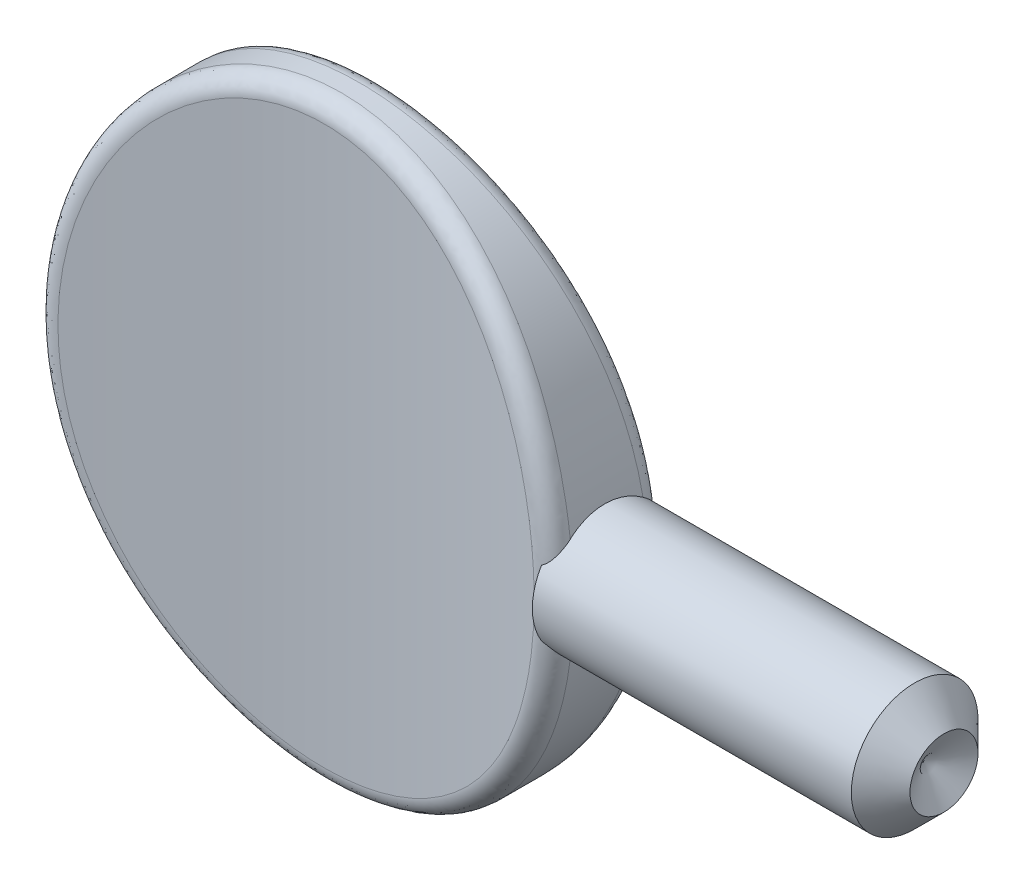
ISO-10303-21;
HEADER;
FILE_DESCRIPTION(('STEP AP214'),'2;1');
FILE_NAME('part.step','',(''),(''),'','','');
FILE_SCHEMA(('AUTOMOTIVE_DESIGN { 1 0 10303 214 1 1 1 1 }'));
ENDSEC;
DATA;
#1=APPLICATION_CONTEXT('core data for automotive mechanical design processes');
#2=APPLICATION_PROTOCOL_DEFINITION('international standard','automotive_design',2000,#1);
#3=PRODUCT_CONTEXT('',#1,'mechanical');
#4=PRODUCT('Part','Part','',(#3));
#5=PRODUCT_RELATED_PRODUCT_CATEGORY('part','',(#4));
#6=PRODUCT_DEFINITION_FORMATION('','',#4);
#7=PRODUCT_DEFINITION_CONTEXT('part definition',#1,'design');
#8=PRODUCT_DEFINITION('design','',#6,#7);
#9=PRODUCT_DEFINITION_SHAPE('','',#8);
#10=(LENGTH_UNIT() NAMED_UNIT(*) SI_UNIT(.MILLI.,.METRE.));
#11=(NAMED_UNIT(*) PLANE_ANGLE_UNIT() SI_UNIT($,.RADIAN.));
#12=(NAMED_UNIT(*) SI_UNIT($,.STERADIAN.) SOLID_ANGLE_UNIT());
#13=UNCERTAINTY_MEASURE_WITH_UNIT(LENGTH_MEASURE(1.E-05),#10,'distance_accuracy_value','');
#14=(GEOMETRIC_REPRESENTATION_CONTEXT(3) GLOBAL_UNCERTAINTY_ASSIGNED_CONTEXT((#13)) GLOBAL_UNIT_ASSIGNED_CONTEXT((#10,
#11,#12)) REPRESENTATION_CONTEXT('',''));
#15=CARTESIAN_POINT('',(0.,0.,0.));
#16=DIRECTION('',(0.,0.,1.));
#17=DIRECTION('',(1.,0.,0.));
#18=AXIS2_PLACEMENT_3D('',#15,#16,#17);
#19=CARTESIAN_POINT('',(0.,0.,2.286));
#20=DIRECTION('',(0.,0.,1.));
#21=DIRECTION('',(0.,-1.,0.));
#22=AXIS2_PLACEMENT_3D('',#19,#20,#21);
#23=ELLIPSE('',#22,11.303,9.906);
#24=DIRECTION('',(0.,0.,-1.));
#25=VECTOR('',#24,1.);
#26=SURFACE_OF_LINEAR_EXTRUSION('',#23,#25);
#27=CARTESIAN_POINT('',(9.7599834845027,-1.93354475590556,1.4435974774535));
#28=CARTESIAN_POINT('',(9.7538599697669,-1.97377990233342,1.3897162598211));
#29=CARTESIAN_POINT('',(9.74788480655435,-2.01176072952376,1.33413671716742));
#30=CARTESIAN_POINT('',(9.73639068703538,-2.08297198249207,1.21996586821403));
#31=CARTESIAN_POINT('',(9.73087174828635,-2.11620222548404,1.1613744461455));
#32=CARTESIAN_POINT('',(9.72044940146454,-2.17767139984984,1.04156116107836));
#33=CARTESIAN_POINT('',(9.71554607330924,-2.20590968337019,0.980338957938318));
#34=CARTESIAN_POINT('',(9.70649644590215,-2.25717945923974,0.85571967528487));
#35=CARTESIAN_POINT('',(9.70235011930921,-2.28021113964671,0.792322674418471));
#36=CARTESIAN_POINT('',(9.69123192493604,-2.34125083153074,0.599394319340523));
#37=CARTESIAN_POINT('',(9.68558076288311,-2.37120394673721,0.467124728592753));
#38=CARTESIAN_POINT('',(9.67850306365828,-2.40853619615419,0.199478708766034));
#39=CARTESIAN_POINT('',(9.67707378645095,-2.4159299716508,0.0641043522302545));
#40=CARTESIAN_POINT('',(9.67858617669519,-2.40802787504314,-0.204493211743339));
#41=CARTESIAN_POINT('',(9.68148053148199,-2.39297760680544,-0.337723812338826));
#42=CARTESIAN_POINT('',(9.6912194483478,-2.34108806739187,-0.599771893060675));
#43=CARTESIAN_POINT('',(9.69806554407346,-2.30424033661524,-0.728587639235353));
#44=CARTESIAN_POINT('',(9.7137074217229,-2.21664920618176,-0.960257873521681));
#45=CARTESIAN_POINT('',(9.72208273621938,-2.16865680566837,-1.06418600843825));
#46=CARTESIAN_POINT('',(9.73584734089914,-2.08614660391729,-1.21400793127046));
#47=CARTESIAN_POINT('',(9.74063407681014,-2.05690073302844,-1.26292205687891));
#48=CARTESIAN_POINT('',(9.7505120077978,-1.99503672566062,-1.35854295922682));
#49=CARTESIAN_POINT('',(9.7556032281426,-1.96241830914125,-1.40524955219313));
#50=CARTESIAN_POINT('',(9.76079800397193,-1.92818422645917,-1.45074966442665));
#51=B_SPLINE_CURVE_WITH_KNOTS('',3,(#27,#28,#29,#30,#31,#32,#33,#34,#35,#36,#37,#38,#39,#40,#41,
#42,#43,#44,#45,#46,#47,#48,#49,#50),.UNSPECIFIED.,.F.,.F.,(4,2,2,2,2,2,2,2,2,2,2,4),(0.,
0.202511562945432,0.405030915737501,0.607576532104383,0.810114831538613,1.2151884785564,
1.61999917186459,2.02041242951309,2.42098118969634,2.76409791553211,2.93554569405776,
3.10700772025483),.UNSPECIFIED.);
#52=CARTESIAN_POINT('',(9.75349384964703,-1.97571933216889,1.3853166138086));
#53=VERTEX_POINT('',#52);
#54=CARTESIAN_POINT('',(9.75349384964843,-1.97571933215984,-1.38531661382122));
#55=VERTEX_POINT('',#54);
#56=EDGE_CURVE('E57',#53,#55,#51,.T.);
#57=ORIENTED_EDGE('',*,*,#56,.F.);
#58=CARTESIAN_POINT('',(9.06433649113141,-0.441553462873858,2.07648141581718));
#59=CARTESIAN_POINT('',(9.89731087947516,-0.473374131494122,2.27409385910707));
#60=CARTESIAN_POINT('',(9.8975763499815,-0.466033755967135,1.41744012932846));
#61=CARTESIAN_POINT('',(9.04072988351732,-1.10521542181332,2.07087783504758));
#62=CARTESIAN_POINT('',(9.87118982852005,-1.18437600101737,2.26734926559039));
#63=CARTESIAN_POINT('',(9.87223120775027,-1.16650607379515,1.41173989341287));
#64=CARTESIAN_POINT('',(8.96387282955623,-1.76690913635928,2.05255322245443));
#65=CARTESIAN_POINT('',(9.7865661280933,-1.89144139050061,2.24540170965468));
#66=CARTESIAN_POINT('',(9.78972693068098,-1.86500634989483,1.39309920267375));
#67=CARTESIAN_POINT('',(8.70423897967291,-3.0674080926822,1.9926113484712));
#68=CARTESIAN_POINT('',(9.49942015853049,-3.28368426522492,2.17332598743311));
#69=CARTESIAN_POINT('',(9.51069658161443,-3.23896299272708,1.33212340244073));
#70=CARTESIAN_POINT('',(8.52144099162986,-3.7062087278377,1.95098942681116));
#71=CARTESIAN_POINT('',(9.2985520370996,-3.96503959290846,2.12360303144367));
#72=CARTESIAN_POINT('',(9.31414769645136,-3.91441472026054,1.28978355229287));
#73=CARTESIAN_POINT('',(8.05223725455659,-4.93844637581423,1.84970425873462));
#74=CARTESIAN_POINT('',(8.78113980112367,-5.28032485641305,2.00228764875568));
#75=CARTESIAN_POINT('',(8.80872239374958,-5.21927582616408,1.18675133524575));
#76=CARTESIAN_POINT('',(7.76638400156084,-5.53210522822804,1.79013749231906));
#77=CARTESIAN_POINT('',(8.46783563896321,-5.91194692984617,1.93136369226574));
#78=CARTESIAN_POINT('',(8.50044492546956,-5.84890960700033,1.12615711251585));
#79=CARTESIAN_POINT('',(7.26256698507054,-6.37458445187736,1.6930635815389));
#80=CARTESIAN_POINT('',(7.91231026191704,-6.81102173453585,1.81528163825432));
#81=CARTESIAN_POINT('',(7.95575827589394,-6.7442759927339,1.02740879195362));
#82=CARTESIAN_POINT('',(7.08198860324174,-6.64756129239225,1.65939540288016));
#83=CARTESIAN_POINT('',(7.71435000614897,-7.10090761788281,1.77525192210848));
#84=CARTESIAN_POINT('',(7.76033985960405,-7.03471301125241,0.99315987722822));
#85=CARTESIAN_POINT('',(6.69635721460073,-7.17472703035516,1.59067374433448));
#86=CARTESIAN_POINT('',(7.29168326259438,-7.66016806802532,1.6936201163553));
#87=CARTESIAN_POINT('',(7.34247562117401,-7.59625745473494,0.923252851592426));
#88=CARTESIAN_POINT('',(6.49131885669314,-7.42892702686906,1.55562110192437));
#89=CARTESIAN_POINT('',(7.06731807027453,-7.92959161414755,1.65205176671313));
#90=CARTESIAN_POINT('',(7.12004597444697,-7.86737629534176,0.887595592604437));
#91=CARTESIAN_POINT('',(6.07339660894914,-7.89779481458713,1.48797563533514));
#92=CARTESIAN_POINT('',(6.61001404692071,-8.42614113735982,1.57189456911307));
#93=CARTESIAN_POINT('',(6.66603588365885,-8.36809358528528,0.818783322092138));
#94=CARTESIAN_POINT('',(5.86216935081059,-8.11399325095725,1.45538942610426));
#95=CARTESIAN_POINT('',(6.37923621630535,-8.65490610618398,1.53333835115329));
#96=CARTESIAN_POINT('',(6.43629914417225,-8.5992777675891,0.785635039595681));
#97=CARTESIAN_POINT('',(5.42046292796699,-8.52495389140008,1.39126982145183));
#98=CARTESIAN_POINT('',(5.89686229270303,-9.08924875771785,1.45756148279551));
#99=CARTESIAN_POINT('',(5.95522830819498,-9.03927334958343,0.720409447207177));
#100=CARTESIAN_POINT('',(5.1899952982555,-8.71972877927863,1.3597358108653));
#101=CARTESIAN_POINT('',(5.64541451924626,-9.29504742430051,1.42032518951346));
#102=CARTESIAN_POINT('',(5.70390714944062,-9.24809798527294,0.688331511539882));
#103=CARTESIAN_POINT('',(4.71121806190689,-9.08513182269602,1.29889201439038));
#104=CARTESIAN_POINT('',(5.12333296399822,-9.68063953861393,1.34857362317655));
#105=CARTESIAN_POINT('',(5.18108360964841,-9.64035101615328,0.626438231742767));
#106=CARTESIAN_POINT('',(4.46292238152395,-9.25577852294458,1.26958052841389));
#107=CARTESIAN_POINT('',(4.85275176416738,-9.86072624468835,1.3140212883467));
#108=CARTESIAN_POINT('',(4.90959697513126,-9.8237989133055,0.596621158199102));
#109=CARTESIAN_POINT('',(3.9501242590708,-9.57035676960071,1.21433232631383));
#110=CARTESIAN_POINT('',(4.29427737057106,-10.1922417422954,1.24898931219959));
#111=CARTESIAN_POINT('',(4.34815021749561,-10.1623803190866,0.540419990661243));
#112=CARTESIAN_POINT('',(3.68562512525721,-9.71429374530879,1.18839492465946));
#113=CARTESIAN_POINT('',(4.00630404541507,-10.343992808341,1.21845738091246));
#114=CARTESIAN_POINT('',(4.05819386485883,-10.3175195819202,0.514035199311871));
#115=CARTESIAN_POINT('',(3.18095813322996,-9.95464296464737,1.14434912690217));
#116=CARTESIAN_POINT('',(3.4570255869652,-10.5971097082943,1.16666988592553));
#117=CARTESIAN_POINT('',(3.50428103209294,-10.5768490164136,0.469229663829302));
#118=CARTESIAN_POINT('',(2.94260311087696,-10.0548925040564,1.12565265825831));
#119=CARTESIAN_POINT('',(3.19771589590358,-10.7026948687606,1.1446903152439));
#120=CARTESIAN_POINT('',(3.24240658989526,-10.6851365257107,0.450210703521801));
#121=CARTESIAN_POINT('',(2.45745188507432,-10.2322329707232,1.09221652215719));
#122=CARTESIAN_POINT('',(2.67025548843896,-10.8892399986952,1.10543443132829));
#123=CARTESIAN_POINT('',(2.70890894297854,-10.8768424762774,0.416197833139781));
#124=CARTESIAN_POINT('',(2.21065722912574,-10.3093281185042,1.0774761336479));
#125=CARTESIAN_POINT('',(2.40189348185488,-10.9703962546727,1.08811890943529));
#126=CARTESIAN_POINT('',(2.43728752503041,-10.96026544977,0.401203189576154));
#127=CARTESIAN_POINT('',(1.71091716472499,-10.4390517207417,1.05249286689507));
#128=CARTESIAN_POINT('',(1.85884865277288,-11.106777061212,1.05881030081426));
#129=CARTESIAN_POINT('',(1.88689681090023,-11.1007143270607,0.375788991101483));
#130=CARTESIAN_POINT('',(1.45797707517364,-10.4917005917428,1.04224623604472));
#131=CARTESIAN_POINT('',(1.58389234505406,-11.162179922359,1.04677989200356));
#132=CARTESIAN_POINT('',(1.60813368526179,-11.157762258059,0.365365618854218));
#133=CARTESIAN_POINT('',(0.948114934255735,-10.5716983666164,1.02661952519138));
#134=CARTESIAN_POINT('',(1.03003449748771,-11.2462512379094,1.02845752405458));
#135=CARTESIAN_POINT('',(1.04597206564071,-11.2444700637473,0.349469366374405));
#136=CARTESIAN_POINT('',(0.691193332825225,-10.5990501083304,1.02123889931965));
#137=CARTESIAN_POINT('',(0.750802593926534,-11.2750269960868,1.02214236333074));
#138=CARTESIAN_POINT('',(0.762574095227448,-11.2741330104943,0.343995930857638));
#139=CARTESIAN_POINT('',(0.209209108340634,-10.6261003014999,1.01591573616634));
#140=CARTESIAN_POINT('',(0.227293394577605,-11.3034522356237,1.01590196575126));
#141=CARTESIAN_POINT('',(0.230834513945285,-11.3034697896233,0.338580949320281));
#142=CARTESIAN_POINT('',(-0.0156831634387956,-10.6289136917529,1.0153606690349));
#143=CARTESIAN_POINT('',(-0.017074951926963,-11.3064105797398,1.01525084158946));
#144=CARTESIAN_POINT('',(-0.0173081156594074,-11.3065216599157,0.338016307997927));
#145=CARTESIAN_POINT('',(-0.464932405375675,-10.6149527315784,1.01810993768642));
#146=CARTESIAN_POINT('',(-0.504998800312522,-11.2917412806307,1.01847351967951));
#147=CARTESIAN_POINT('',(-0.512964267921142,-11.291379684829,0.340812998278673));
#148=CARTESIAN_POINT('',(-0.689289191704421,-10.5981724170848,1.02141544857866));
#149=CARTESIAN_POINT('',(-0.748793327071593,-11.2740929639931,1.02235186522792));
#150=CARTESIAN_POINT('',(-0.760477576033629,-11.2731793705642,0.344175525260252));
#151=CARTESIAN_POINT('',(-1.13556884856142,-10.5452601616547,1.0317883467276));
#152=CARTESIAN_POINT('',(-1.23354170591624,-11.2184912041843,1.03451259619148));
#153=CARTESIAN_POINT('',(-1.25267682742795,-11.2158123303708,0.354727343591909));
#154=CARTESIAN_POINT('',(-1.357492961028,-10.5091386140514,1.03885371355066));
#155=CARTESIAN_POINT('',(-1.47472448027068,-11.18049539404,1.04280421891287));
#156=CARTESIAN_POINT('',(-1.49736421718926,-11.1766568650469,0.361914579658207));
#157=CARTESIAN_POINT('',(-1.79749977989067,-10.4180266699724,1.05654330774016));
#158=CARTESIAN_POINT('',(-1.95276892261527,-11.0847276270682,1.06355029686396));
#159=CARTESIAN_POINT('',(-1.98226996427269,-11.0779503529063,0.379909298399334));
#160=CARTESIAN_POINT('',(-2.01558099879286,-10.3630291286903,1.06716888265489));
#161=CARTESIAN_POINT('',(-2.18983193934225,-11.0268610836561,1.07602492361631));
#162=CARTESIAN_POINT('',(-2.22248659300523,-11.0183915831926,0.390718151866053));
#163=CARTESIAN_POINT('',(-2.44049679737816,-10.2366111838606,1.09134888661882));
#164=CARTESIAN_POINT('',(-2.65162302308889,-10.8939375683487,1.10439715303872));
#165=CARTESIAN_POINT('',(-2.69022849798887,-10.8815920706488,0.415315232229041));
#166=CARTESIAN_POINT('',(-2.64747600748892,-10.1656759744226,1.10481618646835));
#167=CARTESIAN_POINT('',(-2.87668834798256,-10.8192776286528,1.12021587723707));
#168=CARTESIAN_POINT('',(-2.91792129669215,-10.804873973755,0.429014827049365));
#169=CARTESIAN_POINT('',(-3.05512217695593,-10.0074393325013,1.13449174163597));
#170=CARTESIAN_POINT('',(-3.31994587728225,-10.6528031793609,1.15506402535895));
#171=CARTESIAN_POINT('',(-3.36602555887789,-10.6338821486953,0.459202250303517));
#172=CARTESIAN_POINT('',(-3.25578691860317,-9.92013222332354,1.15070094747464));
#173=CARTESIAN_POINT('',(-3.53825524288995,-10.5608636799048,1.17411805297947));
#174=CARTESIAN_POINT('',(-3.58643446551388,-10.5396023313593,0.475691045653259));
#175=CARTESIAN_POINT('',(-3.84654426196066,-9.63504101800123,1.20285461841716));
#176=CARTESIAN_POINT('',(-4.18237180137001,-10.2600882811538,1.23554873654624));
#177=CARTESIAN_POINT('',(-4.23476308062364,-10.2320328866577,0.528744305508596));
#178=CARTESIAN_POINT('',(-4.2257133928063,-9.41399224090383,1.24234388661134));
#179=CARTESIAN_POINT('',(-4.59539551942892,-10.0267310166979,1.2820916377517));
#180=CARTESIAN_POINT('',(-4.6501297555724,-9.99391046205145,0.568914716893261));
#181=CARTESIAN_POINT('',(-4.97579964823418,-8.8988503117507,1.3305459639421));
#182=CARTESIAN_POINT('',(-5.41315254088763,-9.48328684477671,1.38604753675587));
#183=CARTESIAN_POINT('',(-5.47030400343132,-9.44018886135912,0.658638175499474));
#184=CARTESIAN_POINT('',(-5.34372659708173,-8.60038202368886,1.37973973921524));
#185=CARTESIAN_POINT('',(-5.81438792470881,-9.16774150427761,1.44414433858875));
#186=CARTESIAN_POINT('',(-5.87171654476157,-9.11997166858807,0.708680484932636));
#187=CARTESIAN_POINT('',(-6.03184666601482,-7.95150761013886,1.48046815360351));
#188=CARTESIAN_POINT('',(-6.56597991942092,-8.48184990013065,1.56320931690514));
#189=CARTESIAN_POINT('',(-6.62102535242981,-8.42537982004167,0.811146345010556));
#190=CARTESIAN_POINT('',(-6.35201943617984,-7.60107946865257,1.5320037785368));
#191=CARTESIAN_POINT('',(-6.91576322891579,-8.11070576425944,1.6242293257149));
#192=CARTESIAN_POINT('',(-6.96889880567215,-8.05098220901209,0.863570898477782));
#193=CARTESIAN_POINT('',(-6.97998081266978,-6.80920807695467,1.63984325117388));
#194=CARTESIAN_POINT('',(-7.60405609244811,-7.27066586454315,1.75228632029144));
#195=CARTESIAN_POINT('',(-7.65003938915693,-7.20661845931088,0.97327047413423));
#196=CARTESIAN_POINT('',(-7.28060968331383,-6.36185596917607,1.69588343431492));
#197=CARTESIAN_POINT('',(-7.93313272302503,-6.79574608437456,1.81884441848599));
#198=CARTESIAN_POINT('',(-7.97537608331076,-6.73055907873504,1.03027728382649));
#199=CARTESIAN_POINT('',(-7.81370754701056,-5.42598150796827,1.8002849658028));
#200=CARTESIAN_POINT('',(-8.51893240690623,-5.80032940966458,1.94329479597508));
#201=CARTESIAN_POINT('',(-8.55143234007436,-5.73641613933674,1.13647961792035));
#202=CARTESIAN_POINT('',(-8.04612685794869,-4.93742947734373,1.84864070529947));
#203=CARTESIAN_POINT('',(-8.77401400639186,-5.28031393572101,2.00093018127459));
#204=CARTESIAN_POINT('',(-8.80209751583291,-5.218302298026,1.18566943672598));
#205=CARTESIAN_POINT('',(-8.46579777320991,-3.86798278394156,1.93874221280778));
#206=CARTESIAN_POINT('',(-9.23695256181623,-4.13843974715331,2.10886875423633));
#207=CARTESIAN_POINT('',(-9.25424841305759,-4.08562792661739,1.27732508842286));
#208=CARTESIAN_POINT('',(-8.6437754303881,-3.28317788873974,1.97890682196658));
#209=CARTESIAN_POINT('',(-9.43263150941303,-3.51458104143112,2.15687234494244));
#210=CARTESIAN_POINT('',(-9.44567392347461,-3.46710594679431,1.31818248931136));
#211=CARTESIAN_POINT('',(-8.90988228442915,-2.09221318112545,2.03992221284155));
#212=CARTESIAN_POINT('',(-9.726847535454,-2.24001917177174,2.23020914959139));
#213=CARTESIAN_POINT('',(-9.731730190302,-2.20856660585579,1.38025032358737));
#214=CARTESIAN_POINT('',(-8.99807319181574,-1.48606833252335,2.06078625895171));
#215=CARTESIAN_POINT('',(-9.82401541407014,-1.59219662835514,2.25521159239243));
#216=CARTESIAN_POINT('',(-9.8264274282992,-1.56856432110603,1.40147425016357));
#217=CARTESIAN_POINT('',(-9.07155097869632,-0.448175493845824,2.07818799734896));
#218=CARTESIAN_POINT('',(-9.90531304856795,-0.480096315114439,2.27615280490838));
#219=CARTESIAN_POINT('',(-9.90532310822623,-0.472998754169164,1.41917614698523));
#220=CARTESIAN_POINT('',(-9.07960069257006,-0.0180241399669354,2.08010539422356));
#221=CARTESIAN_POINT('',(-9.91421749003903,-0.0195018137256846,2.27845976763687));
#222=CARTESIAN_POINT('',(-9.91396460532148,-0.0190320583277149,1.42112661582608));
#223=CARTESIAN_POINT('',(-9.05114135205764,0.84087466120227,2.07334832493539));
#224=CARTESIAN_POINT('',(-9.88270871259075,0.901272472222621,2.27032260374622));
#225=CARTESIAN_POINT('',(-9.88340958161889,0.88750118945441,1.41425299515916));
#226=CARTESIAN_POINT('',(-9.01462354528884,1.26962181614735,2.06467177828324));
#227=CARTESIAN_POINT('',(-9.84236732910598,1.36026082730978,2.25989703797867));
#228=CARTESIAN_POINT('',(-9.84420366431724,1.34006744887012,1.40542678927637));
#229=CARTESIAN_POINT('',(-8.90937536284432,2.03169863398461,2.04002257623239));
#230=CARTESIAN_POINT('',(-9.72583784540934,2.17696234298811,2.23022004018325));
#231=CARTESIAN_POINT('',(-9.73114985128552,2.14477756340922,1.3803524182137));
#232=CARTESIAN_POINT('',(-8.8489354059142,2.3663077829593,2.02594526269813));
#233=CARTESIAN_POINT('',(-9.659075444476,2.53501090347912,2.21331194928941));
#234=CARTESIAN_POINT('',(-9.66621476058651,2.4982103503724,1.36603228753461));
#235=CARTESIAN_POINT('',(-8.70028670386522,3.02889346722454,1.99186677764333));
#236=CARTESIAN_POINT('',(-9.49474440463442,3.24406808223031,2.17235903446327));
#237=CARTESIAN_POINT('',(-9.50642120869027,3.19839647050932,1.33136598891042));
#238=CARTESIAN_POINT('',(-8.61207087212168,3.35686828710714,1.97186409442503));
#239=CARTESIAN_POINT('',(-9.39741618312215,3.5945847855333,2.14837201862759));
#240=CARTESIAN_POINT('',(-9.41155511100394,3.54514807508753,1.31101828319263));
#241=CARTESIAN_POINT('',(-8.40792982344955,4.00383954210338,1.92654702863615));
#242=CARTESIAN_POINT('',(-9.17207272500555,4.28589025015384,2.09402079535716));
#243=CARTESIAN_POINT('',(-9.19186339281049,4.22959703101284,1.26491955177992));
#244=CARTESIAN_POINT('',(-8.29197010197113,4.32282423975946,1.90122603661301));
#245=CARTESIAN_POINT('',(-9.04433751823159,4.62626387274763,2.0637197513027));
#246=CARTESIAN_POINT('',(-9.06700046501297,4.56728252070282,1.2391618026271));
#247=CARTESIAN_POINT('',(-8.03266921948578,4.94864016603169,1.84612445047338));
#248=CARTESIAN_POINT('',(-8.75862164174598,5.29375063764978,1.99779283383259));
#249=CARTESIAN_POINT('',(-8.78753573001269,5.23032676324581,1.18310977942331));
#250=CARTESIAN_POINT('',(-7.88933080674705,5.25547261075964,1.8163443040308));
#251=CARTESIAN_POINT('',(-8.60101160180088,5.62056800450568,1.96224124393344));
#252=CARTESIAN_POINT('',(-8.63293690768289,5.55568674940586,1.1528159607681));
#253=CARTESIAN_POINT('',(-7.5827057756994,5.84065532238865,1.75476032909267));
#254=CARTESIAN_POINT('',(-8.2637703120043,6.24355498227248,1.88874534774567));
#255=CARTESIAN_POINT('',(-8.30186425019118,6.17681298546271,1.09016973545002));
#256=CARTESIAN_POINT('',(-7.42060725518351,6.11966595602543,1.72310789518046));
#257=CARTESIAN_POINT('',(-8.08585157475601,6.54018510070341,1.85105198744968));
#258=CARTESIAN_POINT('',(-8.12668803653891,6.47325210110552,1.05797133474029));
#259=CARTESIAN_POINT('',(-7.07231803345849,6.66122664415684,1.65771330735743));
#260=CARTESIAN_POINT('',(-7.70361694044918,7.11546435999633,1.77323427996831));
#261=CARTESIAN_POINT('',(-7.74985395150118,7.04926217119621,0.991448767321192));
#262=CARTESIAN_POINT('',(-6.88614017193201,6.92378536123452,1.62397227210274));
#263=CARTESIAN_POINT('',(-7.4996458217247,7.3940837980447,1.73315517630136));
#264=CARTESIAN_POINT('',(-7.54821019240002,7.32884199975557,0.95712573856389));
#265=CARTESIAN_POINT('',(-6.4902981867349,7.42975304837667,1.55555294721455));
#266=CARTESIAN_POINT('',(-7.06608461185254,7.93046508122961,1.65196090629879));
#267=CARTESIAN_POINT('',(-7.11892134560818,7.86825729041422,0.887526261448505));
#268=CARTESIAN_POINT('',(-6.28063663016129,7.67316410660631,1.52087476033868));
#269=CARTESIAN_POINT('',(-6.83678956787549,8.18830586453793,1.61086921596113));
#270=CARTESIAN_POINT('',(-6.89127909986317,8.1280949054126,0.852249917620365));
#271=CARTESIAN_POINT('',(-5.83886074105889,8.13772708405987,1.45187677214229));
#272=CARTESIAN_POINT('',(-6.35382230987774,8.67984460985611,1.52920305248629));
#273=CARTESIAN_POINT('',(-6.41093575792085,8.62464950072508,0.782061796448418));
#274=CARTESIAN_POINT('',(-5.60676139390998,8.35889366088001,1.417556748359));
#275=CARTESIAN_POINT('',(-6.10038934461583,8.91374416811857,1.48862685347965));
#276=CARTESIAN_POINT('',(-6.15825138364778,8.86138170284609,0.747149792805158));
#277=CARTESIAN_POINT('',(-5.14547789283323,8.75521824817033,1.35394959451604));
#278=CARTESIAN_POINT('',(-5.59675257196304,9.33250836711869,1.41349407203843));
#279=CARTESIAN_POINT('',(-5.6553165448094,9.28616485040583,0.682445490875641));
#280=CARTESIAN_POINT('',(-4.91829844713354,8.9327643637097,1.32450134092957));
#281=CARTESIAN_POINT('',(-5.34900946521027,9.52000076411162,1.37874615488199));
#282=CARTESIAN_POINT('',(-5.4073221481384,9.47671576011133,0.652489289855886));
#283=CARTESIAN_POINT('',(-4.44814344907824,9.26490654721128,1.26802841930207));
#284=CARTESIAN_POINT('',(-4.83658148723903,9.87031362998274,1.31219664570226));
#285=CARTESIAN_POINT('',(-4.89341430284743,9.83361103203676,0.595042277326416));
#286=CARTESIAN_POINT('',(-4.20517788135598,9.41951692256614,1.24100224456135));
#287=CARTESIAN_POINT('',(-4.57190339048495,10.0334050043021,1.28035681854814));
#288=CARTESIAN_POINT('',(-4.62751217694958,9.99997048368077,0.567549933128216));
#289=CARTESIAN_POINT('',(-3.7052575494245,9.7034163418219,1.1903933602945));
#290=CARTESIAN_POINT('',(-4.02765051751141,10.3324758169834,1.22081747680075));
#291=CARTESIAN_POINT('',(-4.07971355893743,10.3057842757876,0.516068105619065));
#292=CARTESIAN_POINT('',(-3.44831525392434,9.83272749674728,1.16680764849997));
#293=CARTESIAN_POINT('',(-3.74797965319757,10.4687607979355,1.19306613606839));
#294=CARTESIAN_POINT('',(-3.79783131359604,10.4452621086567,0.492075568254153));
#295=CARTESIAN_POINT('',(-2.92242796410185,10.0639380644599,1.12400959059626));
#296=CARTESIAN_POINT('',(-3.17597688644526,10.7120881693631,1.14278503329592));
#297=CARTESIAN_POINT('',(-3.22025584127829,10.6948915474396,0.448539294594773));
#298=CARTESIAN_POINT('',(-2.65348535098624,10.1658428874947,1.10479638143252));
#299=CARTESIAN_POINT('',(-2.88342317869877,10.8194170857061,1.12020062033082));
#300=CARTESIAN_POINT('',(-2.92456535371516,10.8050489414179,0.428994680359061));
#301=CARTESIAN_POINT('',(-2.14710069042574,10.3272733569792,1.07404899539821));
#302=CARTESIAN_POINT('',(-2.33284413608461,10.9892348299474,1.08410380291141));
#303=CARTESIAN_POINT('',(-2.36731608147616,10.9796823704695,0.397716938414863));
#304=CARTESIAN_POINT('',(-1.91094499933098,10.3908533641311,1.06179682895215));
#305=CARTESIAN_POINT('',(-2.07610071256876,11.0561454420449,1.06971620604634));
#306=CARTESIAN_POINT('',(-2.10724644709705,11.0485217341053,0.385253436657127));
#307=CARTESIAN_POINT('',(-1.43374613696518,10.4958098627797,1.04145662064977));
#308=CARTESIAN_POINT('',(-1.55762642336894,11.1664699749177,1.04586002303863));
#309=CARTESIAN_POINT('',(-1.58142846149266,11.1622105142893,0.364562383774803));
#310=CARTESIAN_POINT('',(-1.19270367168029,10.5371895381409,1.03336798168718));
#311=CARTESIAN_POINT('',(-1.29564078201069,11.2100047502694,1.03636574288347));
#312=CARTESIAN_POINT('',(-1.31568093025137,11.2070633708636,0.356334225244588));
#313=CARTESIAN_POINT('',(-0.707915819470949,10.5970726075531,1.02163323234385));
#314=CARTESIAN_POINT('',(-0.769059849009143,11.2729324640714,1.02260821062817));
#315=CARTESIAN_POINT('',(-0.78102898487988,11.2719859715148,0.344397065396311));
#316=CARTESIAN_POINT('',(-0.464172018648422,10.6155887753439,1.01798464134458));
#317=CARTESIAN_POINT('',(-0.504175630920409,11.2924099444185,1.01832657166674));
#318=CARTESIAN_POINT('',(-0.512126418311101,11.2920695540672,0.340685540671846));
#319=CARTESIAN_POINT('',(0.0239742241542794,10.6294808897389,1.01524901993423));
#320=CARTESIAN_POINT('',(0.0259922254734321,11.3070062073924,1.01512004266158));
#321=CARTESIAN_POINT('',(0.0264470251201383,11.3071368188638,0.337902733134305));
#322=CARTESIAN_POINT('',(0.26837662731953,10.6248581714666,1.01616172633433));
#323=CARTESIAN_POINT('',(0.291583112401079,11.3021433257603,1.01619112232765));
#324=CARTESIAN_POINT('',(0.296117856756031,11.3021219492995,0.33883118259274));
#325=CARTESIAN_POINT('',(0.731015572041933,10.5941897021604,1.02219342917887));
#326=CARTESIAN_POINT('',(0.794042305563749,11.2699210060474,1.02326107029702));
#327=CARTESIAN_POINT('',(0.806497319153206,11.2688626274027,0.344966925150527));
#328=CARTESIAN_POINT('',(0.949402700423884,10.5703538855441,1.02687846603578));
#329=CARTESIAN_POINT('',(1.03135419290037,11.2448516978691,1.02875824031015));
#330=CARTESIAN_POINT('',(1.04738130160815,11.2430144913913,0.349732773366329));
#331=CARTESIAN_POINT('',(1.38344630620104,10.5043595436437,1.03977653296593));
#332=CARTESIAN_POINT('',(1.50284665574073,11.175496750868,1.04388124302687));
#333=CARTESIAN_POINT('',(1.52596681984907,11.1714816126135,0.362853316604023));
#334=CARTESIAN_POINT('',(1.59910191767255,10.4621953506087,1.04799065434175));
#335=CARTESIAN_POINT('',(1.73723082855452,11.1311427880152,1.05352185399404));
#336=CARTESIAN_POINT('',(1.76366734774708,11.1257907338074,0.371209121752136));
#337=CARTESIAN_POINT('',(2.02606245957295,10.3600924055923,1.06772057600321));
#338=CARTESIAN_POINT('',(2.20115032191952,11.0238097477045,1.07666464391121));
#339=CARTESIAN_POINT('',(2.23402228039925,11.0152178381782,0.391279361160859));
#340=CARTESIAN_POINT('',(2.23736912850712,10.3001609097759,1.0792350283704));
#341=CARTESIAN_POINT('',(2.43086687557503,10.9607473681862,1.09018446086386));
#342=CARTESIAN_POINT('',(2.46667870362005,10.9503436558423,0.402992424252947));
#343=CARTESIAN_POINT('',(2.65441619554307,10.1632551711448,1.10525920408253));
#344=CARTESIAN_POINT('',(2.88420079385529,10.8167652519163,1.12072955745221));
#345=CARTESIAN_POINT('',(2.92555248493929,10.8022616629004,0.429465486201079));
#346=CARTESIAN_POINT('',(2.8601544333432,10.0862744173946,1.11977007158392));
#347=CARTESIAN_POINT('',(3.10796098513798,10.7357272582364,1.13777888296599));
#348=CARTESIAN_POINT('',(3.15176734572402,10.719046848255,0.444226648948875));
#349=CARTESIAN_POINT('',(3.47229190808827,9.82882926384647,1.16766697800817));
#350=CARTESIAN_POINT('',(3.77502068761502,10.4642750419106,1.19415299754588));
#351=CARTESIAN_POINT('',(3.82428787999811,10.4410018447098,0.492949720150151));
#352=CARTESIAN_POINT('',(3.86839723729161,9.62312725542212,1.20516354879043));
#353=CARTESIAN_POINT('',(4.20637914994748,10.2471702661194,1.23832898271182));
#354=CARTESIAN_POINT('',(4.25872054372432,10.2191448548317,0.531093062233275));
#355=CARTESIAN_POINT('',(4.6245929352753,9.15366768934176,1.28740400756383));
#356=CARTESIAN_POINT('',(5.03001761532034,9.75240293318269,1.33514205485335));
#357=CARTESIAN_POINT('',(5.08654839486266,9.71393277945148,0.614752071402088));
#358=CARTESIAN_POINT('',(4.9846713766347,8.88989099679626,1.33215028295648));
#359=CARTESIAN_POINT('',(5.42252640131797,9.47370233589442,1.38794594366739));
#360=CARTESIAN_POINT('',(5.47992999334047,9.43055742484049,0.660270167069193));
#361=CARTESIAN_POINT('',(5.69889695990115,8.2831731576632,1.42989181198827));
#362=CARTESIAN_POINT('',(6.20241802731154,8.83257556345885,1.50340477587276));
#363=CARTESIAN_POINT('',(6.25876561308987,8.78017530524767,0.759697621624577));
#364=CARTESIAN_POINT('',(6.04858866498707,7.93486893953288,1.48326169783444));
#365=CARTESIAN_POINT('',(6.58418732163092,8.46389482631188,1.56654004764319));
#366=CARTESIAN_POINT('',(6.63920256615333,8.40755316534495,0.813988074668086));
#367=CARTESIAN_POINT('',(6.69355774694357,7.18955442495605,1.58930188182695));
#368=CARTESIAN_POINT('',(7.28996031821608,7.67454843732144,1.69221318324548));
#369=CARTESIAN_POINT('',(7.33958984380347,7.61192292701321,0.921857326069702));
#370=CARTESIAN_POINT('',(6.98880792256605,6.79251994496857,1.64197181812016));
#371=CARTESIAN_POINT('',(7.61298151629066,7.25337948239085,1.75470923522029));
#372=CARTESIAN_POINT('',(7.65950993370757,7.18888981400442,0.975435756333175));
#373=CARTESIAN_POINT('',(7.55852416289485,5.90352574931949,1.74907555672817));
#374=CARTESIAN_POINT('',(8.23879298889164,6.30821299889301,1.88227557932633));
#375=CARTESIAN_POINT('',(8.27589606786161,6.24338332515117,1.08438690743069));
#376=CARTESIAN_POINT('',(7.82473612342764,5.40599546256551,1.80277922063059));
#377=CARTESIAN_POINT('',(8.53065041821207,5.77912309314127,1.94620221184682));
#378=CARTESIAN_POINT('',(8.56329170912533,5.71520536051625,1.13901689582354));
#379=CARTESIAN_POINT('',(8.2814684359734,4.37513696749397,1.89847802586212));
#380=CARTESIAN_POINT('',(9.03367283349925,4.6801580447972,2.06063032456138));
#381=CARTESIAN_POINT('',(9.05576917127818,4.62251452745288,1.23636639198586));
#382=CARTESIAN_POINT('',(8.47195257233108,3.84179177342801,1.94046756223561));
#383=CARTESIAN_POINT('',(9.24305355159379,4.11150478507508,2.11078670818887));
#384=CARTESIAN_POINT('',(9.26081160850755,4.05798442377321,1.27908019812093));
#385=CARTESIAN_POINT('',(8.79277988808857,2.69157447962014,2.01267902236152));
#386=CARTESIAN_POINT('',(9.59762062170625,2.88109997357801,2.19751575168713));
#387=CARTESIAN_POINT('',(9.60591371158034,2.84172279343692,1.35253722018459));
#388=CARTESIAN_POINT('',(8.91415781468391,2.07198286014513,2.04108919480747));
#389=CARTESIAN_POINT('',(9.73122319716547,2.21931200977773,2.23152481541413));
#390=CARTESIAN_POINT('',(9.73629583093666,2.18724629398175,1.38143743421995));
#391=CARTESIAN_POINT('',(9.06115860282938,0.820487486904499,2.07565423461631));
#392=CARTESIAN_POINT('',(9.89394740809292,0.878268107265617,2.27313745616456));
#393=CARTESIAN_POINT('',(9.8941761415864,0.865911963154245,1.41659868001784));
#394=CARTESIAN_POINT('',(9.0867504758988,0.188579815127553,2.08180189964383));
#395=CARTESIAN_POINT('',(9.9221454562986,0.202610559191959,2.2805062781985));
#396=CARTESIAN_POINT('',(9.92164103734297,0.199050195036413,1.42285238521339));
#397=CARTESIAN_POINT('',(9.06433649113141,-0.441553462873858,2.07648141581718));
#398=CARTESIAN_POINT('',(9.89731087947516,-0.473374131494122,2.27409385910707));
#399=CARTESIAN_POINT('',(9.8975763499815,-0.466033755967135,1.41744012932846));
#400=(BOUNDED_SURFACE() B_SPLINE_SURFACE(3,2,((#58,#59,#60),(#61,#62,#63),(#64,#65,#66),(#67,
#68,#69),(#70,#71,#72),(#73,#74,#75),(#76,#77,#78),(#79,#80,#81),(#82,#83,#84),(#85,#86,#87),
(#88,#89,#90),(#91,#92,#93),(#94,#95,#96),(#97,#98,#99),(#100,#101,#102),(#103,#104,#105),(#106,
#107,#108),(#109,#110,#111),(#112,#113,#114),(#115,#116,#117),(#118,#119,#120),(#121,#122,#123),
(#124,#125,#126),(#127,#128,#129),(#130,#131,#132),(#133,#134,#135),(#136,#137,#138),(#139,#140,
#141),(#142,#143,#144),(#145,#146,#147),(#148,#149,#150),(#151,#152,#153),(#154,#155,#156),
(#157,#158,#159),(#160,#161,#162),(#163,#164,#165),(#166,#167,#168),(#169,#170,#171),(#172,#173,
#174),(#175,#176,#177),(#178,#179,#180),(#181,#182,#183),(#184,#185,#186),(#187,#188,#189),
(#190,#191,#192),(#193,#194,#195),(#196,#197,#198),(#199,#200,#201),(#202,#203,#204),(#205,#206,
#207),(#208,#209,#210),(#211,#212,#213),(#214,#215,#216),(#217,#218,#219),(#220,#221,#222),
(#223,#224,#225),(#226,#227,#228),(#229,#230,#231),(#232,#233,#234),(#235,#236,#237),(#238,#239,
#240),(#241,#242,#243),(#244,#245,#246),(#247,#248,#249),(#250,#251,#252),(#253,#254,#255),
(#256,#257,#258),(#259,#260,#261),(#262,#263,#264),(#265,#266,#267),(#268,#269,#270),(#271,#272,
#273),(#274,#275,#276),(#277,#278,#279),(#280,#281,#282),(#283,#284,#285),(#286,#287,#288),
(#289,#290,#291),(#292,#293,#294),(#295,#296,#297),(#298,#299,#300),(#301,#302,#303),(#304,#305,
#306),(#307,#308,#309),(#310,#311,#312),(#313,#314,#315),(#316,#317,#318),(#319,#320,#321),
(#322,#323,#324),(#325,#326,#327),(#328,#329,#330),(#331,#332,#333),(#334,#335,#336),(#337,#338,
#339),(#340,#341,#342),(#343,#344,#345),(#346,#347,#348),(#349,#350,#351),(#352,#353,#354),
(#355,#356,#357),(#358,#359,#360),(#361,#362,#363),(#364,#365,#366),(#367,#368,#369),(#370,#371,
#372),(#373,#374,#375),(#376,#377,#378),(#379,#380,#381),(#382,#383,#384),(#385,#386,#387),
(#388,#389,#390),(#391,#392,#393),(#394,#395,#396),(#397,#398,#399)),.UNSPECIFIED.,.T.,.F.,
.F.) B_SPLINE_SURFACE_WITH_KNOTS((4,2,2,2,2,2,2,2,2,2,2,2,2,2,2,2,2,2,2,2,2,2,2,2,2,2,2,2,2,2,2,
2,2,2,2,2,2,2,2,2,2,2,2,2,2,2,2,2,2,2,2,2,2,2,2,2,4),(3,3),(0.,1.99013383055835,
3.98066589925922,5.9606813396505,6.95189992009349,7.94252781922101,8.86106937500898,
9.77906414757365,10.6963494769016,11.6134481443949,12.4015093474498,13.1894268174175,
13.9766850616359,14.7638549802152,15.4493720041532,16.135097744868,16.8204553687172,
17.5060726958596,18.1731188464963,18.8403967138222,20.1739641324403,21.6123317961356,
23.0513106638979,24.6794364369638,26.3087451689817,28.1416611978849,29.9733166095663,
31.2617105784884,32.5503576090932,33.5706861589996,34.5912752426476,35.6131402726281,
36.6349027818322,37.6106807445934,38.5859405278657,39.5610938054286,40.5356002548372,
41.4132125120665,42.2902749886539,43.1665674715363,44.0426868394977,44.7880998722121,
45.5334059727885,46.2782954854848,47.0231420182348,47.6927906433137,48.3626464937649,
49.0322291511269,49.7020679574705,51.0579388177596,52.4142570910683,53.9106893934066,
55.4078673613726,57.1081651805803,58.8092751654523,60.6982549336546,62.5878457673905),(0.,1.),
.UNSPECIFIED.) GEOMETRIC_REPRESENTATION_ITEM() RATIONAL_B_SPLINE_SURFACE(((1.,0.620209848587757,
1.),(1.,0.620635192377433,1.),(1.,0.622024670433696,1.),(1.,0.626603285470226,1.),(1.,
0.629792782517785,1.),(1.,0.637645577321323,1.),(1.,0.642300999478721,1.),(1.,0.650003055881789,
1.),(1.,0.652692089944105,1.),(1.,0.658224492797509,1.),(1.,0.661067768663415,1.),(1.,
0.666601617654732,1.),(1.,0.669288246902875,1.),(1.,0.674617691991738,1.),(1.,0.677260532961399,
1.),(1.,0.682400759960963,1.),(1.,0.684898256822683,1.),(1.,0.689641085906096,1.),(1.,
0.691886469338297,1.),(1.,0.695724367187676,1.),(1.,0.697364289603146,1.),(1.,0.700310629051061,
1.),(1.,0.70161710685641,1.),(1.,0.703838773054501,1.),(1.,0.704754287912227,1.),(1.,
0.706152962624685,1.),(1.,0.706636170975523,1.),(1.,0.707114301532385,1.),(1.,0.707164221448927,
1.),(1.,0.706917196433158,1.),(1.,0.706620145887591,1.),(1.,0.70569014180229,1.),(1.,
0.705057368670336,1.),(1.,0.703478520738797,1.),(1.,0.702532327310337,1.),(1.,0.700388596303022,
1.),(1.,0.699198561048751,1.),(1.,0.696589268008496,1.),(1.,0.69516993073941,1.),(1.,
0.690628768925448,1.),(1.,0.687222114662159,1.),(1.,0.679710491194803,1.),(1.,0.675571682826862,
1.),(1.,0.66720877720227,1.),(1.,0.662984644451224,1.),(1.,0.654247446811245,1.),(1.,
0.649769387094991,1.),(1.,0.64151137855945,1.),(1.,0.637731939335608,1.),(1.,0.630738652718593,
1.),(1.,0.627654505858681,1.),(1.,0.622986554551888,1.),(1.,0.621401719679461,1.),(1.,
0.620080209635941,1.),(1.,0.619934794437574,1.),(1.,0.620447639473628,1.),(1.,0.62110605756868,
1.),(1.,0.622982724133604,1.),(1.,0.624055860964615,1.),(1.,0.626663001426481,1.),(1.,
0.628197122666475,1.),(1.,0.631688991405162,1.),(1.,0.633647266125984,1.),(1.,0.637933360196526,
1.),(1.,0.640261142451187,1.),(1.,0.645107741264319,1.),(1.,0.647613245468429,1.),(1.,
0.652827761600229,1.),(1.,0.655536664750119,1.),(1.,0.661073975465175,1.),(1.,0.663902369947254,
1.),(1.,0.669577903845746,1.),(1.,0.672425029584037,1.),(1.,0.677747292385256,1.),(1.,
0.680231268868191,1.),(1.,0.685030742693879,1.),(1.,0.687346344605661,1.),(1.,0.691712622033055,
1.),(1.,0.693763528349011,1.),(1.,0.697507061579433,1.),(1.,0.699199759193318,1.),(1.,
0.701920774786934,1.),(1.,0.703010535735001,1.),(1.,0.704824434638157,1.),(1.,0.705548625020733,
1.),(1.,0.706600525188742,1.),(1.,0.706928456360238,1.),(1.,0.707174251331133,1.),(1.,
0.707092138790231,1.),(1.,0.706550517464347,1.),(1.,0.706129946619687,1.),(1.,0.704975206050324,
1.),(1.,0.704240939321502,1.),(1.,0.702483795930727,1.),(1.,0.701461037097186,1.),(1.,
0.699159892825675,1.),(1.,0.697881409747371,1.),(1.,0.693683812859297,1.),(1.,0.69042545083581,
1.),(1.,0.683371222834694,1.),(1.,0.679575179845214,1.),(1.,0.671389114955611,1.),(1.,
0.666978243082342,1.),(1.,0.658324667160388,1.),(1.,0.654082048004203,1.),(1.,0.6455436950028,
1.),(1.,0.641318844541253,1.),(1.,0.633852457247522,1.),(1.,0.630611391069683,1.),(1.,
0.625064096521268,1.),(1.,0.622900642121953,1.),(1.,0.620271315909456,1.),(1.,0.619805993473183,
1.),(1.,0.620209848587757,1.))) REPRESENTATION_ITEM('') SURFACE());
#401=CARTESIAN_POINT('',(9.8975763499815,-0.466033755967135,1.41744012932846));
#402=CARTESIAN_POINT('',(9.87223120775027,-1.16650607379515,1.41173989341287));
#403=CARTESIAN_POINT('',(9.78972693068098,-1.86500634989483,1.39309920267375));
#404=CARTESIAN_POINT('',(9.51069658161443,-3.23896299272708,1.33212340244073));
#405=CARTESIAN_POINT('',(9.31414769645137,-3.91441472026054,1.28978355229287));
#406=CARTESIAN_POINT('',(8.80872239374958,-5.21927582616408,1.18675133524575));
#407=CARTESIAN_POINT('',(8.50044492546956,-5.84890960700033,1.12615711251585));
#408=CARTESIAN_POINT('',(7.95575827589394,-6.7442759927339,1.02740879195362));
#409=CARTESIAN_POINT('',(7.76033985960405,-7.03471301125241,0.99315987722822));
#410=CARTESIAN_POINT('',(7.34247562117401,-7.59625745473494,0.923252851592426));
#411=CARTESIAN_POINT('',(7.12004597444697,-7.86737629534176,0.887595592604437));
#412=CARTESIAN_POINT('',(6.66603588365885,-8.36809358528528,0.818783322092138));
#413=CARTESIAN_POINT('',(6.43629914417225,-8.5992777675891,0.785635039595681));
#414=CARTESIAN_POINT('',(5.95522830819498,-9.03927334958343,0.720409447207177));
#415=CARTESIAN_POINT('',(5.70390714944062,-9.24809798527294,0.688331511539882));
#416=CARTESIAN_POINT('',(5.18108360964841,-9.64035101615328,0.626438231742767));
#417=CARTESIAN_POINT('',(4.90959697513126,-9.8237989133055,0.596621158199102));
#418=CARTESIAN_POINT('',(4.34815021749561,-10.1623803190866,0.540419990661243));
#419=CARTESIAN_POINT('',(4.05819386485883,-10.3175195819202,0.514035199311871));
#420=CARTESIAN_POINT('',(3.50428103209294,-10.5768490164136,0.469229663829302));
#421=CARTESIAN_POINT('',(3.24240658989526,-10.6851365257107,0.4502107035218));
#422=CARTESIAN_POINT('',(2.70890894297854,-10.8768424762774,0.416197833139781));
#423=CARTESIAN_POINT('',(2.43728752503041,-10.96026544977,0.401203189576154));
#424=CARTESIAN_POINT('',(1.88689681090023,-11.1007143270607,0.375788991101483));
#425=CARTESIAN_POINT('',(1.60813368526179,-11.157762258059,0.365365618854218));
#426=CARTESIAN_POINT('',(1.04597206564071,-11.2444700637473,0.349469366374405));
#427=CARTESIAN_POINT('',(0.762574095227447,-11.2741330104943,0.343995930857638));
#428=CARTESIAN_POINT('',(0.230834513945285,-11.3034697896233,0.338580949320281));
#429=CARTESIAN_POINT('',(-0.0173081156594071,-11.3065216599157,0.338016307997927));
#430=CARTESIAN_POINT('',(-0.512964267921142,-11.291379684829,0.340812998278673));
#431=CARTESIAN_POINT('',(-0.760477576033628,-11.2731793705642,0.344175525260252));
#432=CARTESIAN_POINT('',(-1.25267682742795,-11.2158123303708,0.354727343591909));
#433=CARTESIAN_POINT('',(-1.49736421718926,-11.1766568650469,0.361914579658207));
#434=CARTESIAN_POINT('',(-1.98226996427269,-11.0779503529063,0.379909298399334));
#435=CARTESIAN_POINT('',(-2.22248659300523,-11.0183915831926,0.390718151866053));
#436=CARTESIAN_POINT('',(-2.69022849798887,-10.8815920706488,0.415315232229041));
#437=CARTESIAN_POINT('',(-2.91792129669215,-10.804873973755,0.429014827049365));
#438=CARTESIAN_POINT('',(-3.36602555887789,-10.6338821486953,0.459202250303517));
#439=CARTESIAN_POINT('',(-3.58643446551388,-10.5396023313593,0.475691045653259));
#440=CARTESIAN_POINT('',(-4.23476308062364,-10.2320328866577,0.528744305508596));
#441=CARTESIAN_POINT('',(-4.6501297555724,-9.99391046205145,0.568914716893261));
#442=CARTESIAN_POINT('',(-5.47030400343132,-9.44018886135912,0.658638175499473));
#443=CARTESIAN_POINT('',(-5.87171654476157,-9.11997166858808,0.708680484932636));
#444=CARTESIAN_POINT('',(-6.62102535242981,-8.42537982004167,0.811146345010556));
#445=CARTESIAN_POINT('',(-6.96889880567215,-8.05098220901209,0.863570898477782));
#446=CARTESIAN_POINT('',(-7.65003938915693,-7.20661845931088,0.97327047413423));
#447=CARTESIAN_POINT('',(-7.97537608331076,-6.73055907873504,1.03027728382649));
#448=CARTESIAN_POINT('',(-8.55143234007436,-5.73641613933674,1.13647961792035));
#449=CARTESIAN_POINT('',(-8.80209751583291,-5.218302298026,1.18566943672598));
#450=CARTESIAN_POINT('',(-9.25424841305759,-4.08562792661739,1.27732508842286));
#451=CARTESIAN_POINT('',(-9.44567392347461,-3.46710594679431,1.31818248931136));
#452=CARTESIAN_POINT('',(-9.731730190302,-2.20856660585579,1.38025032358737));
#453=CARTESIAN_POINT('',(-9.8264274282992,-1.56856432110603,1.40147425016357));
#454=CARTESIAN_POINT('',(-9.90532310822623,-0.472998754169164,1.41917614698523));
#455=CARTESIAN_POINT('',(-9.91396460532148,-0.0190320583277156,1.42112661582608));
#456=CARTESIAN_POINT('',(-9.88340958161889,0.88750118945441,1.41425299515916));
#457=CARTESIAN_POINT('',(-9.84420366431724,1.34006744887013,1.40542678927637));
#458=CARTESIAN_POINT('',(-9.73114985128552,2.14477756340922,1.3803524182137));
#459=CARTESIAN_POINT('',(-9.66621476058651,2.4982103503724,1.36603228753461));
#460=CARTESIAN_POINT('',(-9.50642120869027,3.19839647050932,1.33136598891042));
#461=CARTESIAN_POINT('',(-9.41155511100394,3.54514807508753,1.31101828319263));
#462=CARTESIAN_POINT('',(-9.19186339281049,4.22959703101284,1.26491955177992));
#463=CARTESIAN_POINT('',(-9.06700046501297,4.56728252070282,1.2391618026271));
#464=CARTESIAN_POINT('',(-8.78753573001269,5.23032676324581,1.18310977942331));
#465=CARTESIAN_POINT('',(-8.63293690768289,5.55568674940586,1.1528159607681));
#466=CARTESIAN_POINT('',(-8.30186425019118,6.17681298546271,1.09016973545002));
#467=CARTESIAN_POINT('',(-8.12668803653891,6.47325210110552,1.05797133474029));
#468=CARTESIAN_POINT('',(-7.74985395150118,7.04926217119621,0.991448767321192));
#469=CARTESIAN_POINT('',(-7.54821019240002,7.32884199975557,0.95712573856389));
#470=CARTESIAN_POINT('',(-7.11892134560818,7.86825729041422,0.887526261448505));
#471=CARTESIAN_POINT('',(-6.89127909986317,8.12809490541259,0.852249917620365));
#472=CARTESIAN_POINT('',(-6.41093575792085,8.62464950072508,0.782061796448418));
#473=CARTESIAN_POINT('',(-6.15825138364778,8.86138170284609,0.747149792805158));
#474=CARTESIAN_POINT('',(-5.6553165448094,9.28616485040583,0.682445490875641));
#475=CARTESIAN_POINT('',(-5.4073221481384,9.47671576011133,0.652489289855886));
#476=CARTESIAN_POINT('',(-4.89341430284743,9.83361103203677,0.595042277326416));
#477=CARTESIAN_POINT('',(-4.62751217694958,9.99997048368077,0.567549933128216));
#478=CARTESIAN_POINT('',(-4.07971355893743,10.3057842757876,0.516068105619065));
#479=CARTESIAN_POINT('',(-3.79783131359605,10.4452621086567,0.492075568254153));
#480=CARTESIAN_POINT('',(-3.22025584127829,10.6948915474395,0.448539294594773));
#481=CARTESIAN_POINT('',(-2.92456535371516,10.8050489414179,0.428994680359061));
#482=CARTESIAN_POINT('',(-2.36731608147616,10.9796823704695,0.397716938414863));
#483=CARTESIAN_POINT('',(-2.10724644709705,11.0485217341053,0.385253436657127));
#484=CARTESIAN_POINT('',(-1.58142846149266,11.1622105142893,0.364562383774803));
#485=CARTESIAN_POINT('',(-1.31568093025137,11.2070633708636,0.356334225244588));
#486=CARTESIAN_POINT('',(-0.781028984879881,11.2719859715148,0.344397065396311));
#487=CARTESIAN_POINT('',(-0.512126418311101,11.2920695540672,0.340685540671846));
#488=CARTESIAN_POINT('',(0.0264470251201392,11.3071368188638,0.337902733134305));
#489=CARTESIAN_POINT('',(0.296117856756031,11.3021219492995,0.33883118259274));
#490=CARTESIAN_POINT('',(0.806497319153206,11.2688626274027,0.344966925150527));
#491=CARTESIAN_POINT('',(1.04738130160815,11.2430144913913,0.349732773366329));
#492=CARTESIAN_POINT('',(1.52596681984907,11.1714816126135,0.362853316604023));
#493=CARTESIAN_POINT('',(1.76366734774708,11.1257907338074,0.371209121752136));
#494=CARTESIAN_POINT('',(2.23402228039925,11.0152178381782,0.391279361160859));
#495=CARTESIAN_POINT('',(2.46667870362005,10.9503436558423,0.402992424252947));
#496=CARTESIAN_POINT('',(2.92555248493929,10.8022616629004,0.429465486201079));
#497=CARTESIAN_POINT('',(3.15176734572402,10.719046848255,0.444226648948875));
#498=CARTESIAN_POINT('',(3.82428787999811,10.4410018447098,0.492949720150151));
#499=CARTESIAN_POINT('',(4.25872054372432,10.2191448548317,0.531093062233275));
#500=CARTESIAN_POINT('',(5.08654839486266,9.71393277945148,0.614752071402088));
#501=CARTESIAN_POINT('',(5.47992999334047,9.43055742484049,0.660270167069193));
#502=CARTESIAN_POINT('',(6.25876561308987,8.78017530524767,0.759697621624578));
#503=CARTESIAN_POINT('',(6.63920256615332,8.40755316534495,0.813988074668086));
#504=CARTESIAN_POINT('',(7.33958984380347,7.61192292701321,0.921857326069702));
#505=CARTESIAN_POINT('',(7.65950993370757,7.18888981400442,0.975435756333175));
#506=CARTESIAN_POINT('',(8.27589606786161,6.24338332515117,1.08438690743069));
#507=CARTESIAN_POINT('',(8.56329170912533,5.71520536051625,1.13901689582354));
#508=CARTESIAN_POINT('',(9.05576917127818,4.62251452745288,1.23636639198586));
#509=CARTESIAN_POINT('',(9.26081160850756,4.05798442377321,1.27908019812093));
#510=CARTESIAN_POINT('',(9.60591371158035,2.84172279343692,1.35253722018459));
#511=CARTESIAN_POINT('',(9.73629583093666,2.18724629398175,1.38143743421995));
#512=CARTESIAN_POINT('',(9.8941761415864,0.865911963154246,1.41659868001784));
#513=CARTESIAN_POINT('',(9.92164103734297,0.199050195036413,1.42285238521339));
#514=CARTESIAN_POINT('',(9.8975763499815,-0.466033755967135,1.41744012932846));
#515=B_SPLINE_CURVE_WITH_KNOTS('',3,(#401,#402,#403,#404,#405,#406,#407,#408,#409,#410,#411,
#412,#413,#414,#415,#416,#417,#418,#419,#420,#421,#422,#423,#424,#425,#426,#427,#428,#429,#430,
#431,#432,#433,#434,#435,#436,#437,#438,#439,#440,#441,#442,#443,#444,#445,#446,#447,#448,#449,
#450,#451,#452,#453,#454,#455,#456,#457,#458,#459,#460,#461,#462,#463,#464,#465,#466,#467,#468,
#469,#470,#471,#472,#473,#474,#475,#476,#477,#478,#479,#480,#481,#482,#483,#484,#485,#486,#487,
#488,#489,#490,#491,#492,#493,#494,#495,#496,#497,#498,#499,#500,#501,#502,#503,#504,#505,#506,
#507,#508,#509,#510,#511,#512,#513,#514),.UNSPECIFIED.,.T.,.F.,(4,2,2,2,2,2,2,2,2,2,2,2,2,2,2,2,
2,2,2,2,2,2,2,2,2,2,2,2,2,2,2,2,2,2,2,2,2,2,2,2,2,2,2,2,2,2,2,2,2,2,2,2,2,2,2,2,4),(0.,
1.99013383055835,3.98066589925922,5.9606813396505,6.95189992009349,7.94252781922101,
8.86106937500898,9.77906414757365,10.6963494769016,11.6134481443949,12.4015093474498,
13.1894268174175,13.9766850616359,14.7638549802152,15.4493720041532,16.135097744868,
16.8204553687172,17.5060726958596,18.1731188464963,18.8403967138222,20.1739641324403,
21.6123317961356,23.0513106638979,24.6794364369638,26.3087451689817,28.1416611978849,
29.9733166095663,31.2617105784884,32.5503576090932,33.5706861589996,34.5912752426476,
35.6131402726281,36.6349027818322,37.6106807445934,38.5859405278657,39.5610938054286,
40.5356002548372,41.4132125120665,42.2902749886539,43.1665674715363,44.0426868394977,
44.7880998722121,45.5334059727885,46.2782954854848,47.0231420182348,47.6927906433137,
48.3626464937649,49.0322291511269,49.7020679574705,51.0579388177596,52.4142570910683,
53.9106893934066,55.4078673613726,57.1081651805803,58.8092751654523,60.6982549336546,
62.5878457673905),.UNSPECIFIED.);
#516=CARTESIAN_POINT('',(9.7534938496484,1.97571933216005,1.38531661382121));
#517=VERTEX_POINT('',#516);
#518=EDGE_CURVE('E241',#53,#517,#515,.T.);
#519=ORIENTED_EDGE('',*,*,#518,.T.);
#520=CARTESIAN_POINT('',(9.76079800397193,1.92818422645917,-1.45074966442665));
#521=CARTESIAN_POINT('',(9.75466083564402,1.96862478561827,-1.39700972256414));
#522=CARTESIAN_POINT('',(9.74866818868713,2.00681645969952,-1.34156289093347));
#523=CARTESIAN_POINT('',(9.73713205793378,2.07845893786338,-1.22763949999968));
#524=CARTESIAN_POINT('',(9.73158859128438,2.11190956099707,-1.16916282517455));
#525=CARTESIAN_POINT('',(9.72111072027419,2.17382793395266,-1.04955980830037));
#526=CARTESIAN_POINT('',(9.71617639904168,2.20229500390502,-0.988433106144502));
#527=CARTESIAN_POINT('',(9.70705925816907,2.2540288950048,-0.863985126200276));
#528=CARTESIAN_POINT('',(9.70287641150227,2.27729590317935,-0.800663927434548));
#529=CARTESIAN_POINT('',(9.69164180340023,2.33904942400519,-0.607932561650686));
#530=CARTESIAN_POINT('',(9.68590388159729,2.36948895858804,-0.475753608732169));
#531=CARTESIAN_POINT('',(9.67864476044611,2.40779884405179,-0.208203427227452));
#532=CARTESIAN_POINT('',(9.67712081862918,2.415683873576,-0.0728343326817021));
#533=CARTESIAN_POINT('',(9.67844824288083,2.40874880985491,0.195828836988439));
#534=CARTESIAN_POINT('',(9.68125199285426,2.39417581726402,0.329129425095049));
#535=CARTESIAN_POINT('',(9.6908229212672,2.34321884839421,0.591396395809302));
#536=CARTESIAN_POINT('',(9.69759163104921,2.30682644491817,0.72036108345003));
#537=CARTESIAN_POINT('',(9.71310527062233,2.22007436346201,0.952305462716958));
#538=CARTESIAN_POINT('',(9.72142536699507,2.17247999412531,1.05635306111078));
#539=CARTESIAN_POINT('',(9.73512043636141,2.09055582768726,1.20639792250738));
#540=CARTESIAN_POINT('',(9.73988621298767,2.06150341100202,1.25539361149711));
#541=CARTESIAN_POINT('',(9.74972707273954,2.0000218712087,1.35119196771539));
#542=CARTESIAN_POINT('',(9.75480218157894,1.96759246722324,1.39799445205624));
#543=CARTESIAN_POINT('',(9.7599834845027,1.93354475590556,1.4435974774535));
#544=B_SPLINE_CURVE_WITH_KNOTS('',3,(#520,#521,#522,#523,#524,#525,#526,#527,#528,#529,#530,
#531,#532,#533,#534,#535,#536,#537,#538,#539,#540,#541,#542,#543),.UNSPECIFIED.,.F.,.F.,(4,2,2,
2,2,2,2,2,2,2,2,4),(0.,0.202545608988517,0.405098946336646,0.607679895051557,0.810253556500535,
1.2153974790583,1.6202776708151,2.02073475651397,2.42134660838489,2.76428037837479,
2.93563668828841,3.10700726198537),.UNSPECIFIED.);
#545=CARTESIAN_POINT('',(9.75349384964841,1.97571933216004,-1.38531661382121));
#546=VERTEX_POINT('',#545);
#547=EDGE_CURVE('E210',#546,#517,#544,.T.);
#548=ORIENTED_EDGE('',*,*,#547,.F.);
#549=CARTESIAN_POINT('',(-1.05514744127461,-10.5534571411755,-1.03017853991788));
#550=CARTESIAN_POINT('',(-1.14603165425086,-11.2271225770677,-1.03262149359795));
#551=CARTESIAN_POINT('',(-1.16397039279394,-11.224700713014,-0.353089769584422));
#552=CARTESIAN_POINT('',(-0.827458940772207,-10.5847289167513,-1.02405770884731));
#553=CARTESIAN_POINT('',(-0.898900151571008,-11.2599604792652,-1.02545069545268));
#554=CARTESIAN_POINT('',(-0.912887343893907,-11.2586009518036,-0.34686336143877));
#555=CARTESIAN_POINT('',(-0.598396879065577,-10.6059151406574,-1.01988826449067));
#556=CARTESIAN_POINT('',(-0.649982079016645,-11.2822436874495,-1.0205584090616));
#557=CARTESIAN_POINT('',(-0.660203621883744,-11.2815782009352,-0.342621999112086));
#558=CARTESIAN_POINT('',(-0.139298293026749,-10.6278226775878,-1.01557639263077));
#559=CARTESIAN_POINT('',(-0.151355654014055,-11.3052620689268,-1.0155041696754));
#560=CARTESIAN_POINT('',(-0.15369952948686,-11.3053379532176,-0.338235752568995));
#561=CARTESIAN_POINT('',(0.0907381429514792,-10.6285458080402,-1.01543360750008));
#562=CARTESIAN_POINT('',(0.0986071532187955,-11.3060227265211,-1.015336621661));
#563=CARTESIAN_POINT('',(0.100120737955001,-11.306122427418,-0.338090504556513));
#564=CARTESIAN_POINT('',(0.549891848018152,-10.6095191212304,-1.01917926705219));
#565=CARTESIAN_POINT('',(0.597290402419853,-11.2860311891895,-1.01972716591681));
#566=CARTESIAN_POINT('',(0.606693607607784,-11.2854867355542,-0.341900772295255));
#567=CARTESIAN_POINT('',(0.779009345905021,-10.5897747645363,-1.02306663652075));
#568=CARTESIAN_POINT('',(0.846266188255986,-11.265264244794,-1.02428849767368));
#569=CARTESIAN_POINT('',(0.859446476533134,-11.2640724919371,-0.345855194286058));
#570=CARTESIAN_POINT('',(1.23458506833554,-10.5301117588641,-1.03475074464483));
#571=CARTESIAN_POINT('',(1.34112473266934,-11.202566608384,-1.03798704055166));
#572=CARTESIAN_POINT('',(1.36185551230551,-11.1993918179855,-0.357740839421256));
#573=CARTESIAN_POINT('',(1.46104329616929,-10.4901931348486,-1.04254747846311));
#574=CARTESIAN_POINT('',(1.5872476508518,-11.1605734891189,-1.04713781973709));
#575=CARTESIAN_POINT('',(1.61151168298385,-11.1561254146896,-0.365672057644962));
#576=CARTESIAN_POINT('',(1.89781400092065,-10.3933521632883,-1.0613102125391));
#577=CARTESIAN_POINT('',(2.06176721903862,-11.0587855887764,-1.06914254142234));
#578=CARTESIAN_POINT('',(2.09277259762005,-11.051229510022,-0.384758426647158));
#579=CARTESIAN_POINT('',(2.10834995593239,-10.3374325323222,-1.0720883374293));
#580=CARTESIAN_POINT('',(2.29063019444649,-10.9999492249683,-1.08179640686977));
#581=CARTESIAN_POINT('',(2.32463692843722,-10.9906833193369,-0.395722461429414));
#582=CARTESIAN_POINT('',(2.52420004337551,-10.2086701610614,-1.09665786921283));
#583=CARTESIAN_POINT('',(2.74262098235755,-10.8645453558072,-1.11062997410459));
#584=CARTESIAN_POINT('',(2.78232026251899,-10.8513709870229,-0.420715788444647));
#585=CARTESIAN_POINT('',(2.72951248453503,-10.1358220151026,-1.11045023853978));
#586=CARTESIAN_POINT('',(2.96589578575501,-10.7878669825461,-1.12683242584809));
#587=CARTESIAN_POINT('',(3.00813730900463,-10.7725990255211,-0.434746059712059));
#588=CARTESIAN_POINT('',(3.33565183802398,-9.89309571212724,-1.15583886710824));
#589=CARTESIAN_POINT('',(3.62625151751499,-10.5320007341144,-1.18023774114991));
#590=CARTESIAN_POINT('',(3.67429500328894,-10.5103610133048,-0.480917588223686));
#591=CARTESIAN_POINT('',(3.72703622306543,-9.69895534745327,-1.19146279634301));
#592=CARTESIAN_POINT('',(4.05242419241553,-10.3271329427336,-1.2221988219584));
#593=CARTESIAN_POINT('',(4.10373400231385,-10.3008855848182,-0.517155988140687));
#594=CARTESIAN_POINT('',(4.49835272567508,-9.24070181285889,-1.27245583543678));
#595=CARTESIAN_POINT('',(4.8925797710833,-9.84415686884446,-1.3175379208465));
#596=CARTESIAN_POINT('',(4.94852119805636,-9.80749640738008,-0.599546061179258));
#597=CARTESIAN_POINT('',(4.8762179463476,-8.97311265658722,-1.31827865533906));
#598=CARTESIAN_POINT('',(5.30441999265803,-9.56143946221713,-1.37160445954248));
#599=CARTESIAN_POINT('',(5.36151079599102,-9.51989526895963,-0.646159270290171));
#600=CARTESIAN_POINT('',(5.58825223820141,-8.3840232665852,-1.41400152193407));
#601=CARTESIAN_POINT('',(6.0813270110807,-8.93941682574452,-1.48458433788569));
#602=CARTESIAN_POINT('',(6.13823148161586,-8.88818591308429,-0.743533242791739));
#603=CARTESIAN_POINT('',(5.92240236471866,-8.06249979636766,-1.46390332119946));
#604=CARTESIAN_POINT('',(6.44608233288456,-8.59918927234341,-1.54359752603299));
#605=CARTESIAN_POINT('',(6.50194121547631,-8.54405334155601,-0.794295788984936));
#606=CARTESIAN_POINT('',(6.58192295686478,-7.3319303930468,-1.56992130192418));
#607=CARTESIAN_POINT('',(7.16801748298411,-7.82522383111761,-1.66926254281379));
#608=CARTESIAN_POINT('',(7.21853536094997,-7.76372496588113,-0.902142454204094));
#609=CARTESIAN_POINT('',(6.90095128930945,-6.91696615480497,-1.62603296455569));
#610=CARTESIAN_POINT('',(7.5169079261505,-7.38514209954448,-1.73581381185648));
#611=CARTESIAN_POINT('',(7.5643576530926,-7.32139681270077,-0.959221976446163));
#612=CARTESIAN_POINT('',(7.47542188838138,-6.04317566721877,-1.73299531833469));
#613=CARTESIAN_POINT('',(8.14726882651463,-6.45711012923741,-1.86306687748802));
#614=CARTESIAN_POINT('',(8.1860644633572,-6.39179224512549,-1.06802930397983));
#615=CARTESIAN_POINT('',(7.73083178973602,-5.5843272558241,-1.78384332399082));
#616=CARTESIAN_POINT('',(8.42729031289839,-5.96926116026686,-1.92358334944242));
#617=CARTESIAN_POINT('',(8.46191338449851,-5.90449312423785,-1.11975437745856));
#618=CARTESIAN_POINT('',(8.20530857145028,-4.57172813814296,-1.88197004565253));
#619=CARTESIAN_POINT('',(8.94999200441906,-4.88953255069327,-2.04092226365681));
#620=CARTESIAN_POINT('',(8.9737417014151,-4.83070631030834,-1.21957366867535));
#621=CARTESIAN_POINT('',(8.41525964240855,-4.01341264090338,-1.92791319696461));
#622=CARTESIAN_POINT('',(9.18063067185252,-4.29450114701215,-2.09576685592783));
#623=CARTESIAN_POINT('',(9.19979498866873,-4.23957970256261,-1.26630928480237));
#624=CARTESIAN_POINT('',(8.74990976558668,-2.86981158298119,-2.00286808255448));
#625=CARTESIAN_POINT('',(9.55020424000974,-3.07198137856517,-2.18572071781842));
#626=CARTESIAN_POINT('',(9.55982665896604,-3.03010051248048,-1.34255705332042));
#627=CARTESIAN_POINT('',(8.87457264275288,-2.2845146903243,-2.03187263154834));
#628=CARTESIAN_POINT('',(9.68745491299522,-2.44681534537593,-2.22044506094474));
#629=CARTESIAN_POINT('',(9.69376597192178,-2.4117364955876,-1.37206189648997));
#630=CARTESIAN_POINT('',(9.04488672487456,-1.04960178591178,-2.07175851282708));
#631=CARTESIAN_POINT('',(9.87600921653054,-1.12355450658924,-2.26846461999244));
#632=CARTESIAN_POINT('',(9.87671133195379,-1.10773932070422,-1.41263576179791));
#633=CARTESIAN_POINT('',(9.08276303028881,-0.398804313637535,-2.08085341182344));
#634=CARTESIAN_POINT('',(9.91772813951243,-0.427834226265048,-2.27936294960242));
#635=CARTESIAN_POINT('',(9.91736028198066,-0.42091715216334,-1.42188753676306));
#636=CARTESIAN_POINT('',(9.05653545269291,0.900660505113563,-2.07463096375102));
#637=CARTESIAN_POINT('',(9.88867220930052,0.965332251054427,-2.27186496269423));
#638=CARTESIAN_POINT('',(9.88920057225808,0.950592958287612,-1.41555775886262));
#639=CARTESIAN_POINT('',(8.9924063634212,1.54932728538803,-2.05930758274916));
#640=CARTESIAN_POINT('',(9.81804162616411,1.65863037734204,-2.25350601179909));
#641=CARTESIAN_POINT('',(9.82036485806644,1.63528033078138,-1.39997006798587));
#642=CARTESIAN_POINT('',(8.75954173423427,2.84405845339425,-2.00526176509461));
#643=CARTESIAN_POINT('',(9.56046896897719,3.04493606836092,-2.18850614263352));
#644=CARTESIAN_POINT('',(9.57015017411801,3.00289371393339,-1.34499202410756));
#645=CARTESIAN_POINT('',(8.58803632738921,3.48958258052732,-1.96592045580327));
#646=CARTESIAN_POINT('',(9.37196331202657,3.73362718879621,-2.14149239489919));
#647=CARTESIAN_POINT('',(9.38579106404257,3.68527599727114,-1.30497212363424));
#648=CARTESIAN_POINT('',(8.13891883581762,4.74048710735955,-1.86802484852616));
#649=CARTESIAN_POINT('',(8.87651750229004,5.06933395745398,-2.02417663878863));
#650=CARTESIAN_POINT('',(8.90216108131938,5.00947042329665,-1.20538793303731));
#651=CARTESIAN_POINT('',(7.86129456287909,5.34586288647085,-1.80946834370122));
#652=CARTESIAN_POINT('',(8.57216543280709,5.71359847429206,-1.95443177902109));
#653=CARTESIAN_POINT('',(8.60287700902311,5.65127789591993,-1.1458213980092));
#654=CARTESIAN_POINT('',(7.37343049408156,6.19713295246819,-1.71413137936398));
#655=CARTESIAN_POINT('',(8.03394730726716,6.62253325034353,-1.84034941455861));
#656=CARTESIAN_POINT('',(8.07566483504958,6.5555965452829,-1.04883998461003));
#657=CARTESIAN_POINT('',(7.20232981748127,6.46734639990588,-1.68170380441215));
#658=CARTESIAN_POINT('',(7.8462942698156,6.90960356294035,-1.80177242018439));
#659=CARTESIAN_POINT('',(7.89059280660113,6.84295194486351,-1.01585307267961));
#660=CARTESIAN_POINT('',(6.83662527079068,6.99049655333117,-1.61525983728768));
#661=CARTESIAN_POINT('',(7.44528533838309,7.46486372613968,-1.72279637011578));
#662=CARTESIAN_POINT('',(7.49453779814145,7.39991406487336,-0.948263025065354));
#663=CARTESIAN_POINT('',(6.64203429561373,7.24344261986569,-1.58124432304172));
#664=CARTESIAN_POINT('',(7.23225523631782,7.73307234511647,-1.68243352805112));
#665=CARTESIAN_POINT('',(7.28356903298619,7.66953039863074,-0.913660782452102));
#666=CARTESIAN_POINT('',(6.23004598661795,7.7292938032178,-1.51279524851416));
#667=CARTESIAN_POINT('',(6.78136847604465,8.24770239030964,-1.60129453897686));
#668=CARTESIAN_POINT('',(6.83630225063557,8.18804063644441,-0.84403104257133));
#669=CARTESIAN_POINT('',(6.01264772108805,7.96219810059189,-1.47836167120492));
#670=CARTESIAN_POINT('',(6.54377156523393,8.49424413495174,-1.56053142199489));
#671=CARTESIAN_POINT('',(6.60000319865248,8.43693369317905,-0.809003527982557));
#672=CARTESIAN_POINT('',(5.55609993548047,8.40495283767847,-1.41036989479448));
#673=CARTESIAN_POINT('',(6.04501419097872,8.96236010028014,-1.48013820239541));
#674=CARTESIAN_POINT('',(6.1030496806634,8.9107013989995,-0.73983897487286));
#675=CARTESIAN_POINT('',(5.31695421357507,8.61480728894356,-1.37681154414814));
#676=CARTESIAN_POINT('',(5.78403741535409,9.18416231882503,-1.44049577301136));
#677=CARTESIAN_POINT('',(5.84239946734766,9.13558022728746,-0.705701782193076));
#678=CARTESIAN_POINT('',(4.8450164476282,8.98730709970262,-1.31539358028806));
#679=CARTESIAN_POINT('',(5.26907887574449,9.57750384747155,-1.36801261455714));
#680=CARTESIAN_POINT('',(5.3272692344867,9.53527711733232,-0.64322443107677));
#681=CARTESIAN_POINT('',(4.61427282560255,9.15260069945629,-1.28730809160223));
#682=CARTESIAN_POINT('',(5.01757129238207,9.75196563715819,-1.33489694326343));
#683=CARTESIAN_POINT('',(5.07510243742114,9.7128766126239,-0.614654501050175));
#684=CARTESIAN_POINT('',(4.13803680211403,9.46000481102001,-1.2339036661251));
#685=CARTESIAN_POINT('',(4.49878219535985,10.0760110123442,-1.27201089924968));
#686=CARTESIAN_POINT('',(4.55398653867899,10.0435462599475,-0.560328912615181));
#687=CARTESIAN_POINT('',(3.89254773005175,9.60212052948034,-1.20858410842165));
#688=CARTESIAN_POINT('',(4.23145785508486,10.2258589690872,-1.24219936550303));
#689=CARTESIAN_POINT('',(4.28504122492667,10.196621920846,-0.534572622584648));
#690=CARTESIAN_POINT('',(3.38915828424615,9.86067840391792,-1.1617139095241));
#691=CARTESIAN_POINT('',(3.68364716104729,10.4981168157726,-1.18709168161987));
#692=CARTESIAN_POINT('',(3.73289955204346,10.4754114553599,-0.486893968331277));
#693=CARTESIAN_POINT('',(3.13128737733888,9.97717815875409,-1.14015483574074));
#694=CARTESIAN_POINT('',(3.40304545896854,10.6208588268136,-1.16173670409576));
#695=CARTESIAN_POINT('',(3.44973696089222,10.601186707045,-0.464963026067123));
#696=CARTESIAN_POINT('',(2.60501194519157,10.1828115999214,-1.10161391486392));
#697=CARTESIAN_POINT('',(2.83079419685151,10.8371991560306,-1.11647766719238));
#698=CARTESIAN_POINT('',(2.87125496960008,10.8233861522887,-0.425757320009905));
#699=CARTESIAN_POINT('',(2.3366128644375,10.2719592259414,-1.08462973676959));
#700=CARTESIAN_POINT('',(2.53889401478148,10.9310701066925,-1.09652002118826));
#701=CARTESIAN_POINT('',(2.57594184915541,10.9198252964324,-0.408480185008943));
#702=CARTESIAN_POINT('',(1.75351762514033,10.4317266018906,-1.05393866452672));
#703=CARTESIAN_POINT('',(1.90539051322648,11.0990022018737,-1.06052172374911));
#704=CARTESIAN_POINT('',(1.93386895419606,11.0927686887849,-0.377259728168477));
#705=CARTESIAN_POINT('',(1.43761237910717,10.497987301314,-1.04102677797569));
#706=CARTESIAN_POINT('',(1.56188426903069,11.1687749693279,-1.04535246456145));
#707=CARTESIAN_POINT('',(1.58570765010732,11.164572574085,-0.364125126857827));
#708=CARTESIAN_POINT('',(0.799976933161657,10.5909099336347,-1.02285523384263));
#709=CARTESIAN_POINT('',(0.869251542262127,11.2664235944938,-1.02404791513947));
#710=CARTESIAN_POINT('',(0.882602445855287,11.2652980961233,-0.345640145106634));
#711=CARTESIAN_POINT('',(0.478247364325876,10.6175761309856,-1.01759475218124));
#712=CARTESIAN_POINT('',(0.519471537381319,11.2944944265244,-1.01787034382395));
#713=CARTESIAN_POINT('',(0.527659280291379,11.2942243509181,-0.340288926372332));
#714=CARTESIAN_POINT('',(-0.0682323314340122,10.6286285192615,-1.01541579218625));
#715=CARTESIAN_POINT('',(-0.0740772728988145,11.3061140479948,-1.01531478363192));
#716=CARTESIAN_POINT('',(-0.0752803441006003,11.3062128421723,-0.338072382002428));
#717=CARTESIAN_POINT('',(-0.292825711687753,10.6233783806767,-1.01645244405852));
#718=CARTESIAN_POINT('',(-0.318121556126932,11.3005906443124,-1.01653142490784));
#719=CARTESIAN_POINT('',(-0.323090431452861,11.3005172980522,-0.339126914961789));
#720=CARTESIAN_POINT('',(-0.740770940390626,10.5933990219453,-1.02234926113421));
#721=CARTESIAN_POINT('',(-0.804643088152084,11.2690886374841,-1.02344408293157));
#722=CARTESIAN_POINT('',(-0.817258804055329,11.2680049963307,-0.345125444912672));
#723=CARTESIAN_POINT('',(-0.964122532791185,10.5686659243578,-1.02721018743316));
#724=CARTESIAN_POINT('',(-1.04735516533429,11.2430753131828,-1.0291477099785));
#725=CARTESIAN_POINT('',(-1.06361679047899,11.2411840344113,-0.350070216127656));
#726=CARTESIAN_POINT('',(-1.40797290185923,10.5000290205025,-1.0406209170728));
#727=CARTESIAN_POINT('',(-1.52950274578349,11.1709435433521,-1.04487176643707));
#728=CARTESIAN_POINT('',(-1.55300479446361,11.1667885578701,-0.363712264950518));
#729=CARTESIAN_POINT('',(-1.62846988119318,10.4561136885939,-1.04917293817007));
#730=CARTESIAN_POINT('',(-1.76915457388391,11.1247451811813,-1.05490946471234));
#731=CARTESIAN_POINT('',(-1.79603272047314,11.1192015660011,-0.372411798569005));
#732=CARTESIAN_POINT('',(-2.064997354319,10.3496806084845,-1.0697242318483));
#733=CARTESIAN_POINT('',(-2.24348048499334,11.0128572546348,-1.07901662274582));
#734=CARTESIAN_POINT('',(-2.27689966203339,11.0039458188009,-0.393317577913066));
#735=CARTESIAN_POINT('',(-2.28102607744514,10.2871556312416,-1.08172484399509));
#736=CARTESIAN_POINT('',(-2.47834266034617,10.947061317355,-1.09310849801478));
#737=CARTESIAN_POINT('',(-2.51473662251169,10.9362692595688,-0.405525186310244));
#738=CARTESIAN_POINT('',(-2.70630231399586,10.1445626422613,-1.10879046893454));
#739=CARTESIAN_POINT('',(-2.94062602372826,10.7970950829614,-1.12487675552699));
#740=CARTESIAN_POINT('',(-2.98261418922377,10.7820524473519,-0.433057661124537));
#741=CARTESIAN_POINT('',(-2.91557245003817,10.0645621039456,-1.12384367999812));
#742=CARTESIAN_POINT('',(-3.16822720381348,10.7128744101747,-1.14256392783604));
#743=CARTESIAN_POINT('',(-3.21268095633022,10.6955847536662,-0.448370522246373));
#744=CARTESIAN_POINT('',(-3.32697756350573,9.88782172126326,-1.15664605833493));
#745=CARTESIAN_POINT('',(-3.61568460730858,10.5268818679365,-1.18109878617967));
#746=CARTESIAN_POINT('',(-3.66460101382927,10.5047311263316,-0.48173870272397));
#747=CARTESIAN_POINT('',(-3.52910987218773,9.79107569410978,-1.17439622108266));
#748=CARTESIAN_POINT('',(-3.83564814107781,10.4249715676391,-1.20197300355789));
#749=CARTESIAN_POINT('',(-3.88645123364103,10.4003385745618,-0.499795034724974));
#750=CARTESIAN_POINT('',(-4.12297450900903,9.47730737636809,-1.23102590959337));
#751=CARTESIAN_POINT('',(-4.48348010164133,10.0937677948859,-1.26872013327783));
#752=CARTESIAN_POINT('',(-4.53765466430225,10.0621093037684,-0.557401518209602));
#753=CARTESIAN_POINT('',(-4.50255503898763,9.23662516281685,-1.27331009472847));
#754=CARTESIAN_POINT('',(-4.89705844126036,9.83959706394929,-1.31858010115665));
#755=CARTESIAN_POINT('',(-4.95307930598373,9.80308043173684,-0.600415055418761));
#756=CARTESIAN_POINT('',(-5.2461343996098,8.68341029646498,-1.36608166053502));
#757=CARTESIAN_POINT('',(-5.70809530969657,9.25570405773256,-1.42799728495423));
#758=CARTESIAN_POINT('',(-5.76533314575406,9.20902345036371,-0.694786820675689));
#759=CARTESIAN_POINT('',(-5.60736689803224,8.36713314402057,-1.41692954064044));
#760=CARTESIAN_POINT('',(-6.10217437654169,8.92119275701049,-1.48808231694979));
#761=CARTESIAN_POINT('',(-6.15903102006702,8.87005476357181,-0.746511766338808));
#762=CARTESIAN_POINT('',(-6.27982385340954,7.68389509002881,-1.51989476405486));
#763=CARTESIAN_POINT('',(-6.8371331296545,8.1984909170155,-1.60990358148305));
#764=CARTESIAN_POINT('',(-6.89053765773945,8.13942313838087,-0.851253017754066));
#765=CARTESIAN_POINT('',(-6.59102678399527,7.31691249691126,-1.57201264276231));
#766=CARTESIAN_POINT('',(-7.17729182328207,7.80959795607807,-1.67165971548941));
#767=CARTESIAN_POINT('',(-7.22832236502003,7.74773764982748,-0.904269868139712));
#768=CARTESIAN_POINT('',(-7.19878870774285,6.48985192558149,-1.68009098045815));
#769=CARTESIAN_POINT('',(-7.84397268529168,6.93151886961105,-1.80014058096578));
#770=CARTESIAN_POINT('',(-7.88692312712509,6.86669460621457,-1.01421242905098));
#771=CARTESIAN_POINT('',(-7.4876913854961,6.02389479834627,-1.73561953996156));
#772=CARTESIAN_POINT('',(-8.16039077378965,6.43654326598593,-1.86614489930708));
#773=CARTESIAN_POINT('',(-8.19928383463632,6.37129042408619,-1.07069879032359));
#774=CARTESIAN_POINT('',(-7.99454713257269,5.05269582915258,-1.8375361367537));
#775=CARTESIAN_POINT('',(-8.71781573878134,5.40268285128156,-1.98777071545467));
#776=CARTESIAN_POINT('',(-8.74653232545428,5.34047261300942,-1.17437332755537));
#777=CARTESIAN_POINT('',(-8.21246334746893,4.54743374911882,-1.88391942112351));
#778=CARTESIAN_POINT('',(-8.95711903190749,4.86453918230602,-2.04310040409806));
#779=CARTESIAN_POINT('',(-8.98137986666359,4.80503837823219,-1.22155666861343));
#780=CARTESIAN_POINT('',(-8.59764561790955,3.44733249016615,-1.96819545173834));
#781=CARTESIAN_POINT('',(-9.38232249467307,3.68908690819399,-2.14416090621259));
#782=CARTESIAN_POINT('',(-9.39610866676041,3.64064004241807,-1.3072863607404));
#783=CARTESIAN_POINT('',(-8.75571437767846,2.84901408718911,-2.00440498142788));
#784=CARTESIAN_POINT('',(-9.55619672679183,3.05049273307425,-2.1874663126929));
#785=CARTESIAN_POINT('',(-9.56603240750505,3.0081562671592,-1.34412046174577));
#786=CARTESIAN_POINT('',(-8.97988527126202,1.63389975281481,-2.05637282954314));
#787=CARTESIAN_POINT('',(-9.8041668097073,1.74938315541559,-2.24996981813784));
#788=CARTESIAN_POINT('',(-9.8069156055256,1.72458777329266,-1.39698469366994));
#789=CARTESIAN_POINT('',(-9.04595478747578,1.01709734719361,-2.07212389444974));
#790=CARTESIAN_POINT('',(-9.87695804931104,1.090017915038,-2.2688461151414));
#791=CARTESIAN_POINT('',(-9.87783996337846,1.07349654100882,-1.41300744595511));
#792=CARTESIAN_POINT('',(-9.08693902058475,-0.260915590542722,-2.08184011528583));
#793=CARTESIAN_POINT('',(-9.9223657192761,-0.280155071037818,-2.28055467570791));
#794=CARTESIAN_POINT('',(-9.92184453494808,-0.275393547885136,-1.42289125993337));
#795=CARTESIAN_POINT('',(-9.05552268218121,-0.922360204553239,-2.07429232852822));
#796=CARTESIAN_POINT('',(-9.88775589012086,-0.987224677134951,-2.27150873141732));
#797=CARTESIAN_POINT('',(-9.88812906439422,-0.973428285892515,-1.41521328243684));
#798=CARTESIAN_POINT('',(-8.88779292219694,-2.23063226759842,-2.03493417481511));
#799=CARTESIAN_POINT('',(-9.70209684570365,-2.38895497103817,-2.22413159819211));
#800=CARTESIAN_POINT('',(-9.70797242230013,-2.35479910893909,-1.3751762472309));
#801=CARTESIAN_POINT('',(-8.75145635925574,-2.87745645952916,-2.00311845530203));
#802=CARTESIAN_POINT('',(-9.55212911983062,-3.07952296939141,-2.18607443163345));
#803=CARTESIAN_POINT('',(-9.56150638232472,-3.03813191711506,-1.34281174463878));
#804=CARTESIAN_POINT('',(-8.37318929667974,-4.14273870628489,-1.91859766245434));
#805=CARTESIAN_POINT('',(-9.13442329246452,-4.43197940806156,-2.08464787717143));
#806=CARTESIAN_POINT('',(-9.1545160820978,-4.376415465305,-1.25683306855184));
#807=CARTESIAN_POINT('',(-8.13049427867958,-4.76095487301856,-1.86574160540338));
#808=CARTESIAN_POINT('',(-8.86810993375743,-5.09050265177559,-2.02161444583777));
#809=CARTESIAN_POINT('',(-8.89316597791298,-5.03112225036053,-1.20306530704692));
#810=CARTESIAN_POINT('',(-7.68929396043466,-5.64679933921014,-1.7759065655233));
#811=CARTESIAN_POINT('',(-8.38091317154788,-6.03725004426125,-1.91396265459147));
#812=CARTESIAN_POINT('',(-8.41699504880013,-5.97095787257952,-1.11168071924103));
#813=CARTESIAN_POINT('',(-7.52923659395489,-5.93534396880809,-1.74417866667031));
#814=CARTESIAN_POINT('',(-8.20517146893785,-6.34416229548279,-1.87615816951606));
#815=CARTESIAN_POINT('',(-8.24410538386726,-6.27738696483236,-1.07940555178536));
#816=CARTESIAN_POINT('',(-7.18379413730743,-6.49592262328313,-1.6782949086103));
#817=CARTESIAN_POINT('',(-7.82589963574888,-6.93991987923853,-1.79771134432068));
#818=CARTESIAN_POINT('',(-7.87052581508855,-6.87334839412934,-1.01238537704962));
#819=CARTESIAN_POINT('',(-6.99842311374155,-6.76796569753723,-1.64414040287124));
#820=CARTESIAN_POINT('',(-7.62274297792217,-7.22870652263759,-1.75712135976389));
#821=CARTESIAN_POINT('',(-7.6698513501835,-7.16288998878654,-0.977641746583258));
#822=CARTESIAN_POINT('',(-6.61415176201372,-7.27779720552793,-1.5765704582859));
#823=CARTESIAN_POINT('',(-7.2015963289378,-7.76951571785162,-1.67687453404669));
#824=CARTESIAN_POINT('',(-7.25330620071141,-7.70616908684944,-0.908906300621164));
#825=CARTESIAN_POINT('',(-6.41660621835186,-7.51665245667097,-1.54322216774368));
#826=CARTESIAN_POINT('',(-6.98546587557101,-8.022621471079,-1.63733820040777));
#827=CARTESIAN_POINT('',(-7.03893319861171,-7.96100510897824,-0.874982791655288));
#828=CARTESIAN_POINT('',(-6.0003914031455,-7.97431602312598,-1.47657961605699));
#829=CARTESIAN_POINT('',(-6.53025690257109,-8.50706696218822,-1.55841415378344));
#830=CARTESIAN_POINT('',(-6.5866560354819,-8.44988962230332,-0.807190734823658));
#831=CARTESIAN_POINT('',(-5.78173414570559,-8.19313560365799,-1.44328533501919));
#832=CARTESIAN_POINT('',(-6.29140824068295,-8.73856408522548,-1.5190303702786));
#833=CARTESIAN_POINT('',(-6.34876525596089,-8.68394979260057,-0.773322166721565));
#834=CARTESIAN_POINT('',(-5.32441820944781,-8.60794084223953,-1.37795949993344));
#835=CARTESIAN_POINT('',(-5.79209215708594,-9.17687298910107,-1.44185121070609));
#836=CARTESIAN_POINT('',(-5.8505214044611,-9.12821512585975,-0.706869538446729));
#837=CARTESIAN_POINT('',(-5.08577116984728,-8.80393963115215,-1.34592722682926));
#838=CARTESIAN_POINT('',(-5.53177037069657,-9.38393196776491,-1.40403599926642));
#839=CARTESIAN_POINT('',(-5.59018140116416,-9.33843400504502,-0.674284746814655));
#840=CARTESIAN_POINT('',(-4.58986705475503,-9.17032058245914,-1.28436509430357));
#841=CARTESIAN_POINT('',(-4.99112608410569,-9.7704699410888,-1.33145967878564));
#842=CARTESIAN_POINT('',(-5.04843094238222,-9.73189969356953,-0.611660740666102));
#843=CARTESIAN_POINT('',(-4.3326135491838,-9.34070763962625,-1.25483475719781));
#844=CARTESIAN_POINT('',(-4.71082823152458,-9.9502574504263,-1.29665718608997));
#845=CARTESIAN_POINT('',(-4.7670245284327,-9.91515165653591,-0.581621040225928));
#846=CARTESIAN_POINT('',(-3.83603957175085,-9.63265915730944,-1.20312565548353));
#847=CARTESIAN_POINT('',(-4.16989675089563,-10.2579978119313,-1.23578265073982));
#848=CARTESIAN_POINT('',(-4.22309066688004,-10.2295247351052,-0.529020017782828));
#849=CARTESIAN_POINT('',(-3.59873352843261,-9.75769084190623,-1.18049023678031));
#850=CARTESIAN_POINT('',(-3.91157079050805,-10.3897757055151,-1.20914648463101));
#851=CARTESIAN_POINT('',(-3.96286265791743,-10.3643257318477,-0.505994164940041));
#852=CARTESIAN_POINT('',(-3.11325208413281,-9.98432394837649,-1.13884840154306));
#853=CARTESIAN_POINT('',(-3.38342318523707,-10.6283328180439,-1.16021022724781));
#854=CARTESIAN_POINT('',(-3.42991805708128,-10.6088968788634,-0.463634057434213));
#855=CARTESIAN_POINT('',(-2.86507879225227,-10.0859298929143,-1.1198412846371));
#856=CARTESIAN_POINT('',(-3.11344207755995,-10.7353469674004,-1.13786621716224));
#857=CARTESIAN_POINT('',(-3.15720388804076,-10.7186718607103,-0.444299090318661));
#858=CARTESIAN_POINT('',(-2.36013267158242,-10.2639776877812,-1.08617341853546));
#859=CARTESIAN_POINT('',(-2.56449967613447,-10.9226216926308,-1.09834263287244));
#860=CARTESIAN_POINT('',(-2.6018247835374,-10.9111819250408,-0.41005049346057));
#861=CARTESIAN_POINT('',(-2.10336868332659,-10.3404445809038,-1.07150834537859));
#862=CARTESIAN_POINT('',(-2.28530189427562,-11.0031186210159,-1.08111569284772));
#863=CARTESIAN_POINT('',(-2.31917006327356,-10.9939439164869,-0.395132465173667));
#864=CARTESIAN_POINT('',(-1.58340546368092,-10.4669801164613,-1.04707399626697));
#865=CARTESIAN_POINT('',(-1.72031736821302,-11.1361375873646,-1.0524540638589));
#866=CARTESIAN_POINT('',(-1.74638937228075,-11.1309690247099,-0.370276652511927));
#867=CARTESIAN_POINT('',(-1.32020718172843,-10.5170526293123,-1.03730400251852));
#868=CARTESIAN_POINT('',(-1.43420978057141,-11.1888305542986,-1.04098330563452));
#869=CARTESIAN_POINT('',(-1.45626450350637,-11.1852363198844,-0.360338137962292));
#870=CARTESIAN_POINT('',(-1.05514744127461,-10.5534571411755,-1.03017853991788));
#871=CARTESIAN_POINT('',(-1.14603165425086,-11.2271225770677,-1.03262149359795));
#872=CARTESIAN_POINT('',(-1.16397039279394,-11.224700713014,-0.353089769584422));
#873=(BOUNDED_SURFACE() B_SPLINE_SURFACE(3,2,((#549,#550,#551),(#552,#553,#554),(#555,#556,
#557),(#558,#559,#560),(#561,#562,#563),(#564,#565,#566),(#567,#568,#569),(#570,#571,#572),
(#573,#574,#575),(#576,#577,#578),(#579,#580,#581),(#582,#583,#584),(#585,#586,#587),(#588,#589,
#590),(#591,#592,#593),(#594,#595,#596),(#597,#598,#599),(#600,#601,#602),(#603,#604,#605),
(#606,#607,#608),(#609,#610,#611),(#612,#613,#614),(#615,#616,#617),(#618,#619,#620),(#621,#622,
#623),(#624,#625,#626),(#627,#628,#629),(#630,#631,#632),(#633,#634,#635),(#636,#637,#638),
(#639,#640,#641),(#642,#643,#644),(#645,#646,#647),(#648,#649,#650),(#651,#652,#653),(#654,#655,
#656),(#657,#658,#659),(#660,#661,#662),(#663,#664,#665),(#666,#667,#668),(#669,#670,#671),
(#672,#673,#674),(#675,#676,#677),(#678,#679,#680),(#681,#682,#683),(#684,#685,#686),(#687,#688,
#689),(#690,#691,#692),(#693,#694,#695),(#696,#697,#698),(#699,#700,#701),(#702,#703,#704),
(#705,#706,#707),(#708,#709,#710),(#711,#712,#713),(#714,#715,#716),(#717,#718,#719),(#720,#721,
#722),(#723,#724,#725),(#726,#727,#728),(#729,#730,#731),(#732,#733,#734),(#735,#736,#737),
(#738,#739,#740),(#741,#742,#743),(#744,#745,#746),(#747,#748,#749),(#750,#751,#752),(#753,#754,
#755),(#756,#757,#758),(#759,#760,#761),(#762,#763,#764),(#765,#766,#767),(#768,#769,#770),
(#771,#772,#773),(#774,#775,#776),(#777,#778,#779),(#780,#781,#782),(#783,#784,#785),(#786,#787,
#788),(#789,#790,#791),(#792,#793,#794),(#795,#796,#797),(#798,#799,#800),(#801,#802,#803),
(#804,#805,#806),(#807,#808,#809),(#810,#811,#812),(#813,#814,#815),(#816,#817,#818),(#819,#820,
#821),(#822,#823,#824),(#825,#826,#827),(#828,#829,#830),(#831,#832,#833),(#834,#835,#836),
(#837,#838,#839),(#840,#841,#842),(#843,#844,#845),(#846,#847,#848),(#849,#850,#851),(#852,#853,
#854),(#855,#856,#857),(#858,#859,#860),(#861,#862,#863),(#864,#865,#866),(#867,#868,#869),
(#870,#871,#872)),.UNSPECIFIED.,.T.,.F.,.F.) B_SPLINE_SURFACE_WITH_KNOTS((4,2,2,2,2,2,2,2,2,2,2,
2,2,2,2,2,2,2,2,2,2,2,2,2,2,2,2,2,2,2,2,2,2,2,2,2,2,2,2,2,2,2,2,2,2,2,2,2,2,2,2,2,2,4),(3,3),
(0.,0.701136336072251,1.40221040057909,2.10309747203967,2.80398367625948,3.46807350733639,
4.1323756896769,5.45988064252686,6.86636958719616,8.27346605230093,9.8568086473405,
11.4409551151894,13.2321916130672,15.024187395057,16.9713267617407,18.918947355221,
20.9190043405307,22.919291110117,23.8875177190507,24.8552152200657,25.8229522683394,
26.7905206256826,27.6547690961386,28.5188231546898,29.3809140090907,30.2425647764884,
31.2252001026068,32.2077295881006,32.8925140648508,33.5774348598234,34.2627677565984,
34.9483672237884,35.6313649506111,36.3146153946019,37.6799031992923,39.1370432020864,
40.5948085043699,42.2494860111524,43.9050212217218,45.7589195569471,47.6134750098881,
49.5909331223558,51.5688275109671,53.5611786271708,54.5586696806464,55.5556086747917,
56.4962602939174,57.436379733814,58.375955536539,59.3153515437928,60.1326617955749,
60.9498141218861,61.7661499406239,62.5823660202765),(0.,1.),
.UNSPECIFIED.) GEOMETRIC_REPRESENTATION_ITEM() RATIONAL_B_SPLINE_SURFACE(((1.,0.705834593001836,
1.),(1.,0.706382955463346,1.),(1.,0.70675747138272,1.),(1.,0.707144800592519,1.),(1.,
0.707157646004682,1.),(1.,0.706821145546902,1.),(1.,0.706471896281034,1.),(1.,0.705424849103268,
1.),(1.,0.704727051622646,1.),(1.,0.70305403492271,1.),(1.,0.70209530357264,1.),(1.,
0.699919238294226,1.),(1.,0.698701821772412,1.),(1.,0.694715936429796,1.),(1.,0.69161237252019,
1.),(1.,0.684644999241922,1.),(1.,0.680746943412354,1.),(1.,0.672712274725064,1.),(1.,
0.668575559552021,1.),(1.,0.659893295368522,1.),(1.,0.655361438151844,1.),(1.,0.646818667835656,
1.),(1.,0.642808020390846,1.),(1.,0.635131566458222,1.),(1.,0.631579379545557,1.),(1.,
0.625814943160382,1.),(1.,0.623603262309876,1.),(1.,0.620566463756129,1.),(1.,0.619877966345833,
1.),(1.,0.620350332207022,1.),(1.,0.621511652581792,1.),(1.,0.625634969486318,1.),(1.,
0.628644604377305,1.),(1.,0.636218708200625,1.),(1.,0.640783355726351,1.),(1.,0.648326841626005,
1.),(1.,0.650908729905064,1.),(1.,0.656239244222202,1.),(1.,0.658987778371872,1.),(1.,
0.664564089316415,1.),(1.,0.667391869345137,1.),(1.,0.673023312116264,1.),(1.,0.675826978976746,
1.),(1.,0.681001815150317,1.),(1.,0.683387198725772,1.),(1.,0.687955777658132,1.),(1.,
0.690139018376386,1.),(1.,0.694206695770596,1.),(1.,0.696091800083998,1.),(1.,0.699479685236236,
1.),(1.,0.700982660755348,1.),(1.,0.703708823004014,1.),(1.,0.704863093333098,1.),(1.,
0.70649035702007,1.),(1.,0.706963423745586,1.),(1.,0.707159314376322,1.),(1.,0.707066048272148,
1.),(1.,0.706536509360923,1.),(1.,0.706100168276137,1.),(1.,0.704899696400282,1.),(1.,
0.704135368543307,1.),(1.,0.702305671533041,1.),(1.,0.701240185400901,1.),(1.,0.698848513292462,
1.),(1.,0.697523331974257,1.),(1.,0.694651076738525,1.),(1.,0.693103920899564,1.),(1.,
0.688197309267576,1.),(1.,0.684570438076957,1.),(1.,0.67671732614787,1.),(1.,0.672467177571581,
1.),(1.,0.663972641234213,1.),(1.,0.659728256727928,1.),(1.,0.651024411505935,1.),(1.,
0.646613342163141,1.),(1.,0.638594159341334,1.),(1.,0.63498646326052,1.),(1.,0.628471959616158,
1.),(1.,0.625700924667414,1.),(1.,0.621735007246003,1.),(1.,0.620540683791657,1.),(1.,
0.619803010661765,1.),(1.,0.620374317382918,1.),(1.,0.623369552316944,1.),(1.,0.625793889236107,
1.),(1.,0.632297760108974,1.),(1.,0.636389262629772,1.),(1.,0.643439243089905,1.),(1.,
0.645943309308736,1.),(1.,0.651181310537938,1.),(1.,0.653915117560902,1.),(1.,0.659367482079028,
1.),(1.,0.662078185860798,1.),(1.,0.667539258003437,1.),(1.,0.670289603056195,1.),(1.,
0.675730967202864,1.),(1.,0.678422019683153,1.),(1.,0.683636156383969,1.),(1.,0.686159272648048,
1.),(1.,0.690610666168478,1.),(1.,0.692573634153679,1.),(1.,0.696205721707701,1.),(1.,
0.697874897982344,1.),(1.,0.700845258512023,1.),(1.,0.702146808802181,1.),(1.,0.704322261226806,
1.),(1.,0.705196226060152,1.),(1.,0.705834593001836,1.))) REPRESENTATION_ITEM('') SURFACE());
#874=CARTESIAN_POINT('',(-1.16397039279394,-11.224700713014,-0.353089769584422));
#875=CARTESIAN_POINT('',(-0.912887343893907,-11.2586009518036,-0.34686336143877));
#876=CARTESIAN_POINT('',(-0.660203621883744,-11.2815782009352,-0.342621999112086));
#877=CARTESIAN_POINT('',(-0.15369952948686,-11.3053379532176,-0.338235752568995));
#878=CARTESIAN_POINT('',(0.100120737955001,-11.306122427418,-0.338090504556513));
#879=CARTESIAN_POINT('',(0.606693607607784,-11.2854867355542,-0.341900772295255));
#880=CARTESIAN_POINT('',(0.859446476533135,-11.2640724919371,-0.345855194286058));
#881=CARTESIAN_POINT('',(1.36185551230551,-11.1993918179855,-0.357740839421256));
#882=CARTESIAN_POINT('',(1.61151168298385,-11.1561254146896,-0.365672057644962));
#883=CARTESIAN_POINT('',(2.09277259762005,-11.051229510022,-0.384758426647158));
#884=CARTESIAN_POINT('',(2.32463692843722,-10.9906833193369,-0.395722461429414));
#885=CARTESIAN_POINT('',(2.78232026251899,-10.8513709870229,-0.420715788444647));
#886=CARTESIAN_POINT('',(3.00813730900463,-10.7725990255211,-0.434746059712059));
#887=CARTESIAN_POINT('',(3.67429500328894,-10.5103610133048,-0.480917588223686));
#888=CARTESIAN_POINT('',(4.10373400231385,-10.3008855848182,-0.517155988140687));
#889=CARTESIAN_POINT('',(4.94852119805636,-9.80749640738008,-0.599546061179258));
#890=CARTESIAN_POINT('',(5.36151079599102,-9.51989526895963,-0.646159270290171));
#891=CARTESIAN_POINT('',(6.13823148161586,-8.88818591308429,-0.743533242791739));
#892=CARTESIAN_POINT('',(6.50194121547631,-8.54405334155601,-0.794295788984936));
#893=CARTESIAN_POINT('',(7.21853536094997,-7.76372496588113,-0.902142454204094));
#894=CARTESIAN_POINT('',(7.5643576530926,-7.32139681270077,-0.959221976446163));
#895=CARTESIAN_POINT('',(8.1860644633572,-6.39179224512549,-1.06802930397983));
#896=CARTESIAN_POINT('',(8.46191338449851,-5.90449312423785,-1.11975437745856));
#897=CARTESIAN_POINT('',(8.9737417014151,-4.83070631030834,-1.21957366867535));
#898=CARTESIAN_POINT('',(9.19979498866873,-4.23957970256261,-1.26630928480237));
#899=CARTESIAN_POINT('',(9.55982665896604,-3.03010051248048,-1.34255705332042));
#900=CARTESIAN_POINT('',(9.69376597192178,-2.4117364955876,-1.37206189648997));
#901=CARTESIAN_POINT('',(9.87671133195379,-1.10773932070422,-1.41263576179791));
#902=CARTESIAN_POINT('',(9.91736028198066,-0.42091715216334,-1.42188753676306));
#903=CARTESIAN_POINT('',(9.88920057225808,0.950592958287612,-1.41555775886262));
#904=CARTESIAN_POINT('',(9.82036485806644,1.63528033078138,-1.39997006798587));
#905=CARTESIAN_POINT('',(9.57015017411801,3.00289371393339,-1.34499202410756));
#906=CARTESIAN_POINT('',(9.38579106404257,3.68527599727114,-1.30497212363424));
#907=CARTESIAN_POINT('',(8.90216108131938,5.00947042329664,-1.20538793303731));
#908=CARTESIAN_POINT('',(8.60287700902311,5.65127789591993,-1.1458213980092));
#909=CARTESIAN_POINT('',(8.07566483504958,6.5555965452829,-1.04883998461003));
#910=CARTESIAN_POINT('',(7.89059280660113,6.84295194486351,-1.01585307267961));
#911=CARTESIAN_POINT('',(7.49453779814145,7.39991406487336,-0.948263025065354));
#912=CARTESIAN_POINT('',(7.28356903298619,7.66953039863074,-0.913660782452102));
#913=CARTESIAN_POINT('',(6.83630225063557,8.18804063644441,-0.84403104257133));
#914=CARTESIAN_POINT('',(6.60000319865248,8.43693369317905,-0.809003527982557));
#915=CARTESIAN_POINT('',(6.1030496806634,8.9107013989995,-0.73983897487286));
#916=CARTESIAN_POINT('',(5.84239946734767,9.13558022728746,-0.705701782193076));
#917=CARTESIAN_POINT('',(5.3272692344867,9.53527711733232,-0.64322443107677));
#918=CARTESIAN_POINT('',(5.07510243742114,9.7128766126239,-0.614654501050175));
#919=CARTESIAN_POINT('',(4.55398653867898,10.0435462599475,-0.560328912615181));
#920=CARTESIAN_POINT('',(4.28504122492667,10.196621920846,-0.534572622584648));
#921=CARTESIAN_POINT('',(3.73289955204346,10.4754114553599,-0.486893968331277));
#922=CARTESIAN_POINT('',(3.44973696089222,10.601186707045,-0.464963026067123));
#923=CARTESIAN_POINT('',(2.87125496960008,10.8233861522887,-0.425757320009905));
#924=CARTESIAN_POINT('',(2.57594184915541,10.9198252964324,-0.408480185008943));
#925=CARTESIAN_POINT('',(1.93386895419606,11.0927686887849,-0.377259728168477));
#926=CARTESIAN_POINT('',(1.58570765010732,11.164572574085,-0.364125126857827));
#927=CARTESIAN_POINT('',(0.882602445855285,11.2652980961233,-0.345640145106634));
#928=CARTESIAN_POINT('',(0.527659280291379,11.2942243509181,-0.340288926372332));
#929=CARTESIAN_POINT('',(-0.0752803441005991,11.3062128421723,-0.338072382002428));
#930=CARTESIAN_POINT('',(-0.323090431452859,11.3005172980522,-0.339126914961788));
#931=CARTESIAN_POINT('',(-0.817258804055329,11.2680049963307,-0.345125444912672));
#932=CARTESIAN_POINT('',(-1.06361679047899,11.2411840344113,-0.350070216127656));
#933=CARTESIAN_POINT('',(-1.55300479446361,11.1667885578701,-0.363712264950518));
#934=CARTESIAN_POINT('',(-1.79603272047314,11.1192015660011,-0.372411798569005));
#935=CARTESIAN_POINT('',(-2.27689966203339,11.0039458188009,-0.393317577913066));
#936=CARTESIAN_POINT('',(-2.51473662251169,10.9362692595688,-0.405525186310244));
#937=CARTESIAN_POINT('',(-2.98261418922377,10.7820524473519,-0.433057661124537));
#938=CARTESIAN_POINT('',(-3.21268095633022,10.6955847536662,-0.448370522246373));
#939=CARTESIAN_POINT('',(-3.66460101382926,10.5047311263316,-0.48173870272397));
#940=CARTESIAN_POINT('',(-3.88645123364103,10.4003385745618,-0.499795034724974));
#941=CARTESIAN_POINT('',(-4.53765466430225,10.0621093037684,-0.557401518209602));
#942=CARTESIAN_POINT('',(-4.95307930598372,9.80308043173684,-0.600415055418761));
#943=CARTESIAN_POINT('',(-5.76533314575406,9.20902345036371,-0.694786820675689));
#944=CARTESIAN_POINT('',(-6.15903102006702,8.87005476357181,-0.746511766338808));
#945=CARTESIAN_POINT('',(-6.89053765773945,8.13942313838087,-0.851253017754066));
#946=CARTESIAN_POINT('',(-7.22832236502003,7.74773764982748,-0.904269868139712));
#947=CARTESIAN_POINT('',(-7.88692312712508,6.86669460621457,-1.01421242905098));
#948=CARTESIAN_POINT('',(-8.19928383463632,6.37129042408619,-1.07069879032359));
#949=CARTESIAN_POINT('',(-8.74653232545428,5.34047261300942,-1.17437332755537));
#950=CARTESIAN_POINT('',(-8.98137986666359,4.80503837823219,-1.22155666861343));
#951=CARTESIAN_POINT('',(-9.39610866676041,3.64064004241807,-1.3072863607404));
#952=CARTESIAN_POINT('',(-9.56603240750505,3.0081562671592,-1.34412046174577));
#953=CARTESIAN_POINT('',(-9.8069156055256,1.72458777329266,-1.39698469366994));
#954=CARTESIAN_POINT('',(-9.87783996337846,1.07349654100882,-1.41300744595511));
#955=CARTESIAN_POINT('',(-9.92184453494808,-0.275393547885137,-1.42289125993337));
#956=CARTESIAN_POINT('',(-9.88812906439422,-0.973428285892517,-1.41521328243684));
#957=CARTESIAN_POINT('',(-9.70797242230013,-2.35479910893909,-1.3751762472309));
#958=CARTESIAN_POINT('',(-9.56150638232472,-3.03813191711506,-1.34281174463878));
#959=CARTESIAN_POINT('',(-9.1545160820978,-4.376415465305,-1.25683306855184));
#960=CARTESIAN_POINT('',(-8.89316597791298,-5.03112225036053,-1.20306530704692));
#961=CARTESIAN_POINT('',(-8.41699504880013,-5.97095787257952,-1.11168071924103));
#962=CARTESIAN_POINT('',(-8.24410538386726,-6.27738696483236,-1.07940555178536));
#963=CARTESIAN_POINT('',(-7.87052581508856,-6.87334839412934,-1.01238537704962));
#964=CARTESIAN_POINT('',(-7.6698513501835,-7.16288998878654,-0.977641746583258));
#965=CARTESIAN_POINT('',(-7.25330620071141,-7.70616908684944,-0.908906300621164));
#966=CARTESIAN_POINT('',(-7.03893319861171,-7.96100510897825,-0.874982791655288));
#967=CARTESIAN_POINT('',(-6.5866560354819,-8.44988962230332,-0.807190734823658));
#968=CARTESIAN_POINT('',(-6.34876525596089,-8.68394979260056,-0.773322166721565));
#969=CARTESIAN_POINT('',(-5.8505214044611,-9.12821512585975,-0.706869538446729));
#970=CARTESIAN_POINT('',(-5.59018140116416,-9.33843400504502,-0.674284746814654));
#971=CARTESIAN_POINT('',(-5.04843094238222,-9.73189969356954,-0.611660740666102));
#972=CARTESIAN_POINT('',(-4.7670245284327,-9.91515165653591,-0.581621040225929));
#973=CARTESIAN_POINT('',(-4.22309066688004,-10.2295247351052,-0.529020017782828));
#974=CARTESIAN_POINT('',(-3.96286265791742,-10.3643257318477,-0.505994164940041));
#975=CARTESIAN_POINT('',(-3.42991805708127,-10.6088968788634,-0.463634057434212));
#976=CARTESIAN_POINT('',(-3.15720388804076,-10.7186718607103,-0.444299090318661));
#977=CARTESIAN_POINT('',(-2.6018247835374,-10.9111819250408,-0.41005049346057));
#978=CARTESIAN_POINT('',(-2.31917006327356,-10.9939439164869,-0.395132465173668));
#979=CARTESIAN_POINT('',(-1.74638937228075,-11.1309690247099,-0.370276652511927));
#980=CARTESIAN_POINT('',(-1.45626450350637,-11.1852363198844,-0.360338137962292));
#981=CARTESIAN_POINT('',(-1.16397039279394,-11.224700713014,-0.353089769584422));
#982=B_SPLINE_CURVE_WITH_KNOTS('',3,(#874,#875,#876,#877,#878,#879,#880,#881,#882,#883,#884,
#885,#886,#887,#888,#889,#890,#891,#892,#893,#894,#895,#896,#897,#898,#899,#900,#901,#902,#903,
#904,#905,#906,#907,#908,#909,#910,#911,#912,#913,#914,#915,#916,#917,#918,#919,#920,#921,#922,
#923,#924,#925,#926,#927,#928,#929,#930,#931,#932,#933,#934,#935,#936,#937,#938,#939,#940,#941,
#942,#943,#944,#945,#946,#947,#948,#949,#950,#951,#952,#953,#954,#955,#956,#957,#958,#959,#960,
#961,#962,#963,#964,#965,#966,#967,#968,#969,#970,#971,#972,#973,#974,#975,#976,#977,#978,#979,
#980,#981),.UNSPECIFIED.,.T.,.F.,(4,2,2,2,2,2,2,2,2,2,2,2,2,2,2,2,2,2,2,2,2,2,2,2,2,2,2,2,2,2,2,
2,2,2,2,2,2,2,2,2,2,2,2,2,2,2,2,2,2,2,2,2,2,4),(0.,0.701136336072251,1.40221040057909,
2.10309747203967,2.80398367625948,3.46807350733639,4.1323756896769,5.45988064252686,
6.86636958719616,8.27346605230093,9.8568086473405,11.4409551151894,13.2321916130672,
15.024187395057,16.9713267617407,18.918947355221,20.9190043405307,22.919291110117,
23.8875177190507,24.8552152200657,25.8229522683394,26.7905206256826,27.6547690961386,
28.5188231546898,29.3809140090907,30.2425647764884,31.2252001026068,32.2077295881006,
32.8925140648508,33.5774348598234,34.2627677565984,34.9483672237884,35.6313649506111,
36.3146153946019,37.6799031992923,39.1370432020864,40.5948085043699,42.2494860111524,
43.9050212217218,45.7589195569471,47.6134750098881,49.5909331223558,51.5688275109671,
53.5611786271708,54.5586696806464,55.5556086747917,56.4962602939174,57.436379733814,
58.375955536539,59.3153515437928,60.1326617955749,60.9498141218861,61.7661499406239,
62.5823660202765),.UNSPECIFIED.);
#983=EDGE_CURVE('E141',#546,#55,#982,.T.);
#984=ORIENTED_EDGE('',*,*,#983,.T.);
#985=EDGE_LOOP('',(#57,#519,#548,#984));
#986=FACE_BOUND('',#985,.T.);
#987=ADVANCED_FACE('F36',(#986),#26,.F.);
#988=CARTESIAN_POINT('',(9.33667851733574,1.25701799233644,2.05972686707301));
#989=CARTESIAN_POINT('',(9.33666252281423,1.22790294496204,2.06118290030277));
#990=CARTESIAN_POINT('',(9.3358333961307,1.1988102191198,2.06277698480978));
#991=CARTESIAN_POINT('',(9.33281404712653,1.14072190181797,2.06610935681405));
#992=CARTESIAN_POINT('',(9.33062476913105,1.11172625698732,2.06784754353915));
#993=CARTESIAN_POINT('',(9.32515473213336,1.05389910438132,2.07133528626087));
#994=CARTESIAN_POINT('',(9.32187605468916,1.02506738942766,2.07308481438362));
#995=CARTESIAN_POINT('',(9.31440285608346,0.967513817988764,2.07650395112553));
#996=CARTESIAN_POINT('',(9.31020815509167,0.93879198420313,2.07817354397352));
#997=CARTESIAN_POINT('',(9.29650093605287,0.85300081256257,2.08292700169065));
#998=CARTESIAN_POINT('',(9.2858436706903,0.796100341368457,2.08576915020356));
#999=CARTESIAN_POINT('',(9.26228458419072,0.682703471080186,2.09039016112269));
#1000=CARTESIAN_POINT('',(9.24938165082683,0.626207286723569,2.09216849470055));
#1001=CARTESIAN_POINT('',(9.2240413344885,0.522633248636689,2.09417918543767));
#1002=CARTESIAN_POINT('',(9.21186039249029,0.475496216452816,2.09461353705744));
#1003=CARTESIAN_POINT('',(9.18654207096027,0.381493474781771,2.09444670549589));
#1004=CARTESIAN_POINT('',(9.17340485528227,0.33462772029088,2.093845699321));
#1005=CARTESIAN_POINT('',(9.1328669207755,0.19437844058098,2.0903762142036));
#1006=CARTESIAN_POINT('',(9.10434161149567,0.101349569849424,2.0858411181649));
#1007=CARTESIAN_POINT('',(9.07404387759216,0.00585800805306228,2.07878356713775));
#1008=CARTESIAN_POINT('',(9.07311349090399,0.00292877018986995,2.0785647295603));
#1009=CARTESIAN_POINT('',(9.07218228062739,0.,2.07834357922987));
#1010=B_SPLINE_CURVE_WITH_KNOTS('',3,(#988,#989,#990,#991,#992,#993,#994,#995,#996,#997,#998,
#999,#1000,#1001,#1002,#1003,#1004,#1005,#1006,#1007,#1008,#1009),.UNSPECIFIED.,.F.,.F.,(4,2,2,
2,2,2,2,2,2,2,4),(0.,0.0874211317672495,0.174781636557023,0.261976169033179,0.349187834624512,
0.522990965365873,0.696880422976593,0.842918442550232,0.988931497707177,1.28097823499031,
1.2902219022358),.UNSPECIFIED.);
#1011=CARTESIAN_POINT('',(9.07218228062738,0.,2.07834357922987));
#1012=VERTEX_POINT('',#1011);
#1013=CARTESIAN_POINT('',(9.33667851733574,1.25701799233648,2.059726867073));
#1014=VERTEX_POINT('',#1013);
#1015=EDGE_CURVE('E198',#1012,#1014,#1010,.F.);
#1016=ORIENTED_EDGE('',*,*,#1015,.T.);
#1017=CARTESIAN_POINT('',(9.33667851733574,1.25701799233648,2.059726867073));
#1018=CARTESIAN_POINT('',(9.35334675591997,1.2647268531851,2.05502410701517));
#1019=CARTESIAN_POINT('',(9.36936811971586,1.27333407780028,2.0497102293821));
#1020=CARTESIAN_POINT('',(9.40010595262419,1.29191586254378,2.03804817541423));
#1021=CARTESIAN_POINT('',(9.41482745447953,1.30188473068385,2.03170428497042));
#1022=CARTESIAN_POINT('',(9.45686658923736,1.33304005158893,2.01151135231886));
#1023=CARTESIAN_POINT('',(9.48247052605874,1.35568684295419,1.99637553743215));
#1024=CARTESIAN_POINT('',(9.53988164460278,1.41314169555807,1.95634703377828));
#1025=CARTESIAN_POINT('',(9.56962049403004,1.44899098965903,1.93005782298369));
#1026=CARTESIAN_POINT('',(9.62256347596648,1.52224346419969,1.87284135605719));
#1027=CARTESIAN_POINT('',(9.64571586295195,1.55965643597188,1.84188014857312));
#1028=CARTESIAN_POINT('',(9.6865769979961,1.63596762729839,1.77450859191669));
#1029=CARTESIAN_POINT('',(9.70400194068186,1.67485889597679,1.73791861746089));
#1030=CARTESIAN_POINT('',(9.73183611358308,1.75113462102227,1.6610289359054));
#1031=CARTESIAN_POINT('',(9.74227510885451,1.78852482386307,1.62074581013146));
#1032=CARTESIAN_POINT('',(9.75394089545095,1.85135238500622,1.54813226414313));
#1033=CARTESIAN_POINT('',(9.7568788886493,1.87732496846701,1.51653440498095));
#1034=CARTESIAN_POINT('',(9.75848190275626,1.92776455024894,1.45189445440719));
#1035=CARTESIAN_POINT('',(9.75713294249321,1.9522263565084,1.41884798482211));
#1036=CARTESIAN_POINT('',(9.75349384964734,1.97571933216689,1.38531661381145));
#1037=B_SPLINE_CURVE_WITH_KNOTS('',3,(#1017,#1018,#1019,#1020,#1021,#1022,#1023,#1024,#1025,
#1026,#1027,#1028,#1029,#1030,#1031,#1032,#1033,#1034,#1035,#1036),.UNSPECIFIED.,.F.,.F.,(4,2,2,
2,2,2,2,2,2,4),(0.,0.0567524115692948,0.113274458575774,0.224906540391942,0.384551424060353,
0.545417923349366,0.71335098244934,0.880563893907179,1.00332662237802,1.12649013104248),.UNSPECIFIED.);
#1038=EDGE_CURVE('E204',#1014,#517,#1037,.T.);
#1039=ORIENTED_EDGE('',*,*,#1038,.T.);
#1040=ORIENTED_EDGE('',*,*,#518,.F.);
#1041=CARTESIAN_POINT('',(9.75349384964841,-1.97571933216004,1.38531661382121));
#1042=CARTESIAN_POINT('',(9.75604080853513,-1.95926695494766,1.40878830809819));
#1043=CARTESIAN_POINT('',(9.7574645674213,-1.94233662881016,1.43203727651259));
#1044=CARTESIAN_POINT('',(9.75815819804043,-1.90765011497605,1.47792459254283));
#1045=CARTESIAN_POINT('',(9.75742928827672,-1.88989440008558,1.5005632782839));
#1046=CARTESIAN_POINT('',(9.75391662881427,-1.85370803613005,1.5450428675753));
#1047=CARTESIAN_POINT('',(9.75113739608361,-1.83527895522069,1.56688541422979));
#1048=CARTESIAN_POINT('',(9.74365291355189,-1.79782737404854,1.60971881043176));
#1049=CARTESIAN_POINT('',(9.73894739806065,-1.77880479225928,1.63070954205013));
#1050=CARTESIAN_POINT('',(9.72734453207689,-1.73936168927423,1.67274055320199));
#1051=CARTESIAN_POINT('',(9.72035110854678,-1.71891833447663,1.69373289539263));
#1052=CARTESIAN_POINT('',(9.70438119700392,-1.67768175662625,1.73458795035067));
#1053=CARTESIAN_POINT('',(9.69540457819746,-1.6568885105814,1.75445058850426));
#1054=CARTESIAN_POINT('',(9.67543847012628,-1.6150863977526,1.79300712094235));
#1055=CARTESIAN_POINT('',(9.66444481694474,-1.5940771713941,1.81169848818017));
#1056=CARTESIAN_POINT('',(9.64643007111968,-1.56260831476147,1.83875396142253));
#1057=CARTESIAN_POINT('',(9.64017155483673,-1.55212685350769,1.84760832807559));
#1058=CARTESIAN_POINT('',(9.63041208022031,-1.53643124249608,1.86064347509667));
#1059=CARTESIAN_POINT('',(9.62709704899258,-1.53120391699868,1.86494736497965));
#1060=CARTESIAN_POINT('',(9.62200494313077,-1.52338332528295,1.87133205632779));
#1061=CARTESIAN_POINT('',(9.62028766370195,-1.52077988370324,1.87344841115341));
#1062=CARTESIAN_POINT('',(9.61686109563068,-1.51556078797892,1.87767293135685));
#1063=CARTESIAN_POINT('',(9.6151518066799,-1.51294513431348,1.87978109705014));
#1064=CARTESIAN_POINT('',(9.61221308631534,-1.50862586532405,1.88324771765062));
#1065=CARTESIAN_POINT('',(9.61101568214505,-1.50691146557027,1.88461978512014));
#1066=CARTESIAN_POINT('',(9.60863495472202,-1.50347303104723,1.88736393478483));
#1067=CARTESIAN_POINT('',(9.60745163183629,-1.50174899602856,1.88873601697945));
#1068=CARTESIAN_POINT('',(9.60387185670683,-1.49658382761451,1.89283524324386));
#1069=CARTESIAN_POINT('',(9.6014456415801,-1.49314969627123,1.89554531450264));
#1070=CARTESIAN_POINT('',(9.5940828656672,-1.48286265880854,1.90361845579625));
#1071=CARTESIAN_POINT('',(9.58906221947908,-1.47602517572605,1.90892440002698));
#1072=CARTESIAN_POINT('',(9.57363234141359,-1.45560808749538,1.92459563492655));
#1073=CARTESIAN_POINT('',(9.56285202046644,-1.44211915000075,1.93471808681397));
#1074=CARTESIAN_POINT('',(9.54031439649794,-1.41558590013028,1.95421465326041));
#1075=CARTESIAN_POINT('',(9.52856293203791,-1.40253951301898,1.96359265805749));
#1076=CARTESIAN_POINT('',(9.51011019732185,-1.38337012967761,1.97709819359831));
#1077=CARTESIAN_POINT('',(9.50382124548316,-1.37704662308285,1.98150673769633));
#1078=CARTESIAN_POINT('',(9.49416338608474,-1.36768842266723,1.98796675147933));
#1079=CARTESIAN_POINT('',(9.49090675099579,-1.36459025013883,1.99009458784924));
#1080=CARTESIAN_POINT('',(9.48597748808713,-1.35996788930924,1.99325356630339));
#1081=CARTESIAN_POINT('',(9.48432704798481,-1.35843128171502,1.99430107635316));
#1082=CARTESIAN_POINT('',(9.4818219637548,-1.35614665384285,1.99585473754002));
#1083=CARTESIAN_POINT('',(9.48098205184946,-1.35538850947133,1.99636967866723));
#1084=CARTESIAN_POINT('',(9.47932666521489,-1.35385329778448,1.99741109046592));
#1085=CARTESIAN_POINT('',(9.47851119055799,-1.35307623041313,1.99793756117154));
#1086=CARTESIAN_POINT('',(9.47640995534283,-1.35116061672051,1.99923385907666));
#1087=CARTESIAN_POINT('',(9.47509793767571,-1.35004159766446,1.99998966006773));
#1088=CARTESIAN_POINT('',(9.47250390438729,-1.34777927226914,2.00151487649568));
#1089=CARTESIAN_POINT('',(9.47122189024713,-1.34663596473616,2.0022842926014));
#1090=CARTESIAN_POINT('',(9.46734838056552,-1.34322527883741,2.00457538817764));
#1091=CARTESIAN_POINT('',(9.46472952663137,-1.34097723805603,2.00607984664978));
#1092=CARTESIAN_POINT('',(9.45681334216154,-1.33427392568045,2.01054986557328));
#1093=CARTESIAN_POINT('',(9.45145679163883,-1.32985982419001,2.01347182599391));
#1094=CARTESIAN_POINT('',(9.43511440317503,-1.31684146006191,2.02203004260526));
#1095=CARTESIAN_POINT('',(9.42384677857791,-1.30845288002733,2.02746420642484));
#1096=CARTESIAN_POINT('',(9.40041703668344,-1.29232274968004,2.03778389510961));
#1097=CARTESIAN_POINT('',(9.38824687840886,-1.28458878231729,2.04266316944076));
#1098=CARTESIAN_POINT('',(9.363079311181,-1.27004855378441,2.05173594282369));
#1099=CARTESIAN_POINT('',(9.35007985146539,-1.26324473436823,2.05592764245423));
#1100=CARTESIAN_POINT('',(9.33667851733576,-1.25701799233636,2.05972686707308));
#1101=B_SPLINE_CURVE_WITH_KNOTS('',3,(#1041,#1042,#1043,#1044,#1045,#1046,#1047,#1048,#1049,
#1050,#1051,#1052,#1053,#1054,#1055,#1056,#1057,#1058,#1059,#1060,#1061,#1062,#1063,#1064,#1065,
#1066,#1067,#1068,#1069,#1070,#1071,#1072,#1073,#1074,#1075,#1076,#1077,#1078,#1079,#1080,#1081,
#1082,#1083,#1084,#1085,#1086,#1087,#1088,#1089,#1090,#1091,#1092,#1093,#1094,#1095,#1096,#1097,
#1098,#1099,#1100),.UNSPECIFIED.,.F.,.F.,(4,2,2,2,2,2,2,2,2,2,2,2,2,2,2,2,2,2,2,2,2,2,2,2,2,2,2,
2,2,4),(0.,0.0862918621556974,0.172534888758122,0.258588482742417,0.34465395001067,
0.434935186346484,0.525222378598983,0.615698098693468,0.660930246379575,0.683545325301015,
0.694852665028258,0.70615956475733,0.713662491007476,0.721165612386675,0.736172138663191,
0.766185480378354,0.826191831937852,0.885860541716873,0.915698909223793,0.930617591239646,
0.938076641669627,0.941805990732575,0.945535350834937,0.95118185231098,0.95682863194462,
0.968122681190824,0.990712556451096,1.03585201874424,1.08145799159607,1.12718147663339),.UNSPECIFIED.);
#1102=CARTESIAN_POINT('',(9.33667851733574,-1.25701799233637,2.05972686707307));
#1103=VERTEX_POINT('',#1102);
#1104=EDGE_CURVE('E215',#53,#1103,#1101,.T.);
#1105=ORIENTED_EDGE('',*,*,#1104,.T.);
#1106=CARTESIAN_POINT('',(9.33667851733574,-1.25701799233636,2.05972686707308));
#1107=CARTESIAN_POINT('',(9.33666150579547,-1.22790179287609,2.06116594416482));
#1108=CARTESIAN_POINT('',(9.33583151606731,-1.19880855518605,2.06275413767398));
#1109=CARTESIAN_POINT('',(9.33281083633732,-1.14071986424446,2.06608456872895));
#1110=CARTESIAN_POINT('',(9.33062109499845,-1.11172435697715,2.06782669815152));
#1111=CARTESIAN_POINT('',(9.32515064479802,-1.05389767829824,2.07131987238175));
#1112=CARTESIAN_POINT('',(9.32187203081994,-1.02506629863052,2.07307089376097));
#1113=CARTESIAN_POINT('',(9.31439909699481,-0.967513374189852,2.07649338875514));
#1114=CARTESIAN_POINT('',(9.31020459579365,-0.938791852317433,2.07816484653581));
#1115=CARTESIAN_POINT('',(9.29650002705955,-0.853000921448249,2.08292526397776));
#1116=CARTESIAN_POINT('',(9.2858472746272,-0.796099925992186,2.08577386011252));
#1117=CARTESIAN_POINT('',(9.26228675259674,-0.682703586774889,2.09039426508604));
#1118=CARTESIAN_POINT('',(9.24937785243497,-0.626208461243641,2.09216553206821));
#1119=CARTESIAN_POINT('',(9.22404448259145,-0.522632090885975,2.09418167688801));
#1120=CARTESIAN_POINT('',(9.21187357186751,-0.475492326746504,2.09462559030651));
#1121=CARTESIAN_POINT('',(9.18656775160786,-0.381485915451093,2.09446676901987));
#1122=CARTESIAN_POINT('',(9.17343301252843,-0.334619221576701,2.09386421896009));
#1123=CARTESIAN_POINT('',(9.1328892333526,-0.194371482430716,2.09038661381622));
#1124=CARTESIAN_POINT('',(9.10434236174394,-0.101349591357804,2.08584144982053));
#1125=CARTESIAN_POINT('',(9.07404385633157,-0.00585801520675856,2.07878355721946));
#1126=CARTESIAN_POINT('',(9.07311346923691,-0.00292877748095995,2.07856471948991));
#1127=CARTESIAN_POINT('',(9.07218228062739,0.,2.07834357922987));
#1128=B_SPLINE_CURVE_WITH_KNOTS('',3,(#1106,#1107,#1108,#1109,#1110,#1111,#1112,#1113,#1114,
#1115,#1116,#1117,#1118,#1119,#1120,#1121,#1122,#1123,#1124,#1125,#1126,#1127),.UNSPECIFIED.,
.F.,.F.,(4,2,2,2,2,2,2,2,2,2,4),(0.,0.087421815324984,0.174782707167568,0.261976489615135,
0.349187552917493,0.522990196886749,0.696880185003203,0.842919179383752,0.988932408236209,
1.28097992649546,1.29022359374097),.UNSPECIFIED.);
#1129=EDGE_CURVE('E131',#1103,#1012,#1128,.T.);
#1130=ORIENTED_EDGE('',*,*,#1129,.T.);
#1131=CARTESIAN_POINT('',(9.06433649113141,-0.441553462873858,2.07648141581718));
#1132=CARTESIAN_POINT('',(9.0867504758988,0.188579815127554,2.08180189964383));
#1133=CARTESIAN_POINT('',(9.06115860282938,0.820487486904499,2.07565423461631));
#1134=CARTESIAN_POINT('',(8.91415781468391,2.07198286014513,2.04108919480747));
#1135=CARTESIAN_POINT('',(8.79277988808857,2.69157447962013,2.01267902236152));
#1136=CARTESIAN_POINT('',(8.47195257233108,3.84179177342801,1.94046756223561));
#1137=CARTESIAN_POINT('',(8.2814684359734,4.37513696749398,1.89847802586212));
#1138=CARTESIAN_POINT('',(7.82473612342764,5.40599546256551,1.80277922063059));
#1139=CARTESIAN_POINT('',(7.55852416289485,5.90352574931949,1.74907555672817));
#1140=CARTESIAN_POINT('',(6.98880792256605,6.79251994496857,1.64197181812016));
#1141=CARTESIAN_POINT('',(6.69355774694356,7.18955442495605,1.58930188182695));
#1142=CARTESIAN_POINT('',(6.04858866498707,7.93486893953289,1.48326169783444));
#1143=CARTESIAN_POINT('',(5.69889695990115,8.2831731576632,1.42989181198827));
#1144=CARTESIAN_POINT('',(4.9846713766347,8.88989099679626,1.33215028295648));
#1145=CARTESIAN_POINT('',(4.6245929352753,9.15366768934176,1.28740400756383));
#1146=CARTESIAN_POINT('',(3.86839723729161,9.62312725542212,1.20516354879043));
#1147=CARTESIAN_POINT('',(3.47229190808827,9.82882926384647,1.16766697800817));
#1148=CARTESIAN_POINT('',(2.8601544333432,10.0862744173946,1.11977007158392));
#1149=CARTESIAN_POINT('',(2.65441619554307,10.1632551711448,1.10525920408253));
#1150=CARTESIAN_POINT('',(2.23736912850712,10.3001609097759,1.0792350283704));
#1151=CARTESIAN_POINT('',(2.02606245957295,10.3600924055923,1.06772057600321));
#1152=CARTESIAN_POINT('',(1.59910191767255,10.4621953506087,1.04799065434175));
#1153=CARTESIAN_POINT('',(1.38344630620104,10.5043595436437,1.03977653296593));
#1154=CARTESIAN_POINT('',(0.949402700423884,10.5703538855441,1.02687846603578));
#1155=CARTESIAN_POINT('',(0.731015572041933,10.5941897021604,1.02219342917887));
#1156=CARTESIAN_POINT('',(0.26837662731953,10.6248581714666,1.01616172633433));
#1157=CARTESIAN_POINT('',(0.0239742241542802,10.6294808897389,1.01524901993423));
#1158=CARTESIAN_POINT('',(-0.464172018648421,10.6155887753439,1.01798464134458));
#1159=CARTESIAN_POINT('',(-0.707915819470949,10.5970726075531,1.02163323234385));
#1160=CARTESIAN_POINT('',(-1.19270367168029,10.5371895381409,1.03336798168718));
#1161=CARTESIAN_POINT('',(-1.43374613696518,10.4958098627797,1.04145662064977));
#1162=CARTESIAN_POINT('',(-1.91094499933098,10.3908533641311,1.06179682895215));
#1163=CARTESIAN_POINT('',(-2.14710069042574,10.3272733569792,1.07404899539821));
#1164=CARTESIAN_POINT('',(-2.65348535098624,10.1658428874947,1.10479638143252));
#1165=CARTESIAN_POINT('',(-2.92242796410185,10.0639380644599,1.12400959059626));
#1166=CARTESIAN_POINT('',(-3.44831525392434,9.83272749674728,1.16680764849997));
#1167=CARTESIAN_POINT('',(-3.7052575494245,9.7034163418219,1.1903933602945));
#1168=CARTESIAN_POINT('',(-4.20517788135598,9.41951692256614,1.24100224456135));
#1169=CARTESIAN_POINT('',(-4.44814344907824,9.26490654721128,1.26802841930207));
#1170=CARTESIAN_POINT('',(-4.91829844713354,8.9327643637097,1.32450134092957));
#1171=CARTESIAN_POINT('',(-5.14547789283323,8.75521824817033,1.35394959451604));
#1172=CARTESIAN_POINT('',(-5.60676139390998,8.35889366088,1.417556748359));
#1173=CARTESIAN_POINT('',(-5.8388607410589,8.13772708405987,1.45187677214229));
#1174=CARTESIAN_POINT('',(-6.2806366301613,7.67316410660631,1.52087476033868));
#1175=CARTESIAN_POINT('',(-6.4902981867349,7.42975304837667,1.55555294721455));
#1176=CARTESIAN_POINT('',(-6.88614017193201,6.92378536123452,1.62397227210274));
#1177=CARTESIAN_POINT('',(-7.07231803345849,6.66122664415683,1.65771330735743));
#1178=CARTESIAN_POINT('',(-7.42060725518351,6.11966595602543,1.72310789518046));
#1179=CARTESIAN_POINT('',(-7.5827057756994,5.84065532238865,1.75476032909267));
#1180=CARTESIAN_POINT('',(-7.88933080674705,5.25547261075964,1.8163443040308));
#1181=CARTESIAN_POINT('',(-8.03266921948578,4.94864016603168,1.84612445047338));
#1182=CARTESIAN_POINT('',(-8.29197010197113,4.32282423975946,1.90122603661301));
#1183=CARTESIAN_POINT('',(-8.40792982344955,4.00383954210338,1.92654702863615));
#1184=CARTESIAN_POINT('',(-8.61207087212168,3.35686828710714,1.97186409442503));
#1185=CARTESIAN_POINT('',(-8.70028670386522,3.02889346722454,1.99186677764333));
#1186=CARTESIAN_POINT('',(-8.8489354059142,2.3663077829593,2.02594526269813));
#1187=CARTESIAN_POINT('',(-8.90937536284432,2.03169863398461,2.04002257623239));
#1188=CARTESIAN_POINT('',(-9.01462354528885,1.26962181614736,2.06467177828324));
#1189=CARTESIAN_POINT('',(-9.05114135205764,0.840874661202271,2.07334832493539));
#1190=CARTESIAN_POINT('',(-9.07960069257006,-0.018024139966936,2.08010539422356));
#1191=CARTESIAN_POINT('',(-9.07155097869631,-0.448175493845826,2.07818799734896));
#1192=CARTESIAN_POINT('',(-8.99807319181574,-1.48606833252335,2.06078625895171));
#1193=CARTESIAN_POINT('',(-8.90988228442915,-2.09221318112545,2.03992221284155));
#1194=CARTESIAN_POINT('',(-8.6437754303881,-3.28317788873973,1.97890682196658));
#1195=CARTESIAN_POINT('',(-8.46579777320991,-3.86798278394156,1.93874221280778));
#1196=CARTESIAN_POINT('',(-8.04612685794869,-4.93742947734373,1.84864070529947));
#1197=CARTESIAN_POINT('',(-7.81370754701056,-5.42598150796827,1.8002849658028));
#1198=CARTESIAN_POINT('',(-7.28060968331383,-6.36185596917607,1.69588343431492));
#1199=CARTESIAN_POINT('',(-6.97998081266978,-6.80920807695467,1.63984325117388));
#1200=CARTESIAN_POINT('',(-6.35201943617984,-7.60107946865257,1.5320037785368));
#1201=CARTESIAN_POINT('',(-6.03184666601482,-7.95150761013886,1.48046815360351));
#1202=CARTESIAN_POINT('',(-5.34372659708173,-8.60038202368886,1.37973973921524));
#1203=CARTESIAN_POINT('',(-4.97579964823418,-8.8988503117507,1.3305459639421));
#1204=CARTESIAN_POINT('',(-4.2257133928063,-9.41399224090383,1.24234388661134));
#1205=CARTESIAN_POINT('',(-3.84654426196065,-9.63504101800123,1.20285461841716));
#1206=CARTESIAN_POINT('',(-3.25578691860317,-9.92013222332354,1.15070094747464));
#1207=CARTESIAN_POINT('',(-3.05512217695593,-10.0074393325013,1.13449174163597));
#1208=CARTESIAN_POINT('',(-2.64747600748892,-10.1656759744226,1.10481618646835));
#1209=CARTESIAN_POINT('',(-2.44049679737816,-10.2366111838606,1.09134888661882));
#1210=CARTESIAN_POINT('',(-2.01558099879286,-10.3630291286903,1.06716888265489));
#1211=CARTESIAN_POINT('',(-1.79749977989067,-10.4180266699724,1.05654330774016));
#1212=CARTESIAN_POINT('',(-1.357492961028,-10.5091386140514,1.03885371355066));
#1213=CARTESIAN_POINT('',(-1.13556884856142,-10.5452601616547,1.0317883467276));
#1214=CARTESIAN_POINT('',(-0.689289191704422,-10.5981724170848,1.02141544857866));
#1215=CARTESIAN_POINT('',(-0.464932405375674,-10.6149527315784,1.01810993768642));
#1216=CARTESIAN_POINT('',(-0.0156831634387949,-10.6289136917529,1.0153606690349));
#1217=CARTESIAN_POINT('',(0.209209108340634,-10.6261003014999,1.01591573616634));
#1218=CARTESIAN_POINT('',(0.691193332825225,-10.5990501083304,1.02123889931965));
#1219=CARTESIAN_POINT('',(0.948114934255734,-10.5716983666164,1.02661952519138));
#1220=CARTESIAN_POINT('',(1.45797707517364,-10.4917005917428,1.04224623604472));
#1221=CARTESIAN_POINT('',(1.71091716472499,-10.4390517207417,1.05249286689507));
#1222=CARTESIAN_POINT('',(2.21065722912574,-10.3093281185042,1.0774761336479));
#1223=CARTESIAN_POINT('',(2.45745188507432,-10.2322329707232,1.09221652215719));
#1224=CARTESIAN_POINT('',(2.94260311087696,-10.0548925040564,1.12565265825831));
#1225=CARTESIAN_POINT('',(3.18095813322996,-9.95464296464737,1.14434912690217));
#1226=CARTESIAN_POINT('',(3.68562512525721,-9.71429374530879,1.18839492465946));
#1227=CARTESIAN_POINT('',(3.9501242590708,-9.57035676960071,1.21433232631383));
#1228=CARTESIAN_POINT('',(4.46292238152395,-9.25577852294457,1.26958052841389));
#1229=CARTESIAN_POINT('',(4.71121806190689,-9.08513182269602,1.29889201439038));
#1230=CARTESIAN_POINT('',(5.1899952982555,-8.71972877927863,1.3597358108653));
#1231=CARTESIAN_POINT('',(5.42046292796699,-8.52495389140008,1.39126982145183));
#1232=CARTESIAN_POINT('',(5.86216935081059,-8.11399325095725,1.45538942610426));
#1233=CARTESIAN_POINT('',(6.07339660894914,-7.89779481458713,1.48797563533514));
#1234=CARTESIAN_POINT('',(6.49131885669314,-7.42892702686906,1.55562110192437));
#1235=CARTESIAN_POINT('',(6.69635721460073,-7.17472703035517,1.59067374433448));
#1236=CARTESIAN_POINT('',(7.08198860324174,-6.64756129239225,1.65939540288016));
#1237=CARTESIAN_POINT('',(7.26256698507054,-6.37458445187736,1.6930635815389));
#1238=CARTESIAN_POINT('',(7.76638400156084,-5.53210522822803,1.79013749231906));
#1239=CARTESIAN_POINT('',(8.05223725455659,-4.93844637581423,1.84970425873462));
#1240=CARTESIAN_POINT('',(8.52144099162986,-3.70620872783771,1.95098942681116));
#1241=CARTESIAN_POINT('',(8.70423897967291,-3.0674080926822,1.9926113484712));
#1242=CARTESIAN_POINT('',(8.96387282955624,-1.76690913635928,2.05255322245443));
#1243=CARTESIAN_POINT('',(9.04072988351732,-1.10521542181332,2.07087783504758));
#1244=CARTESIAN_POINT('',(9.06433649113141,-0.441553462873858,2.07648141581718));
#1245=B_SPLINE_CURVE_WITH_KNOTS('',3,(#1131,#1132,#1133,#1134,#1135,#1136,#1137,#1138,#1139,
#1140,#1141,#1142,#1143,#1144,#1145,#1146,#1147,#1148,#1149,#1150,#1151,#1152,#1153,#1154,#1155,
#1156,#1157,#1158,#1159,#1160,#1161,#1162,#1163,#1164,#1165,#1166,#1167,#1168,#1169,#1170,#1171,
#1172,#1173,#1174,#1175,#1176,#1177,#1178,#1179,#1180,#1181,#1182,#1183,#1184,#1185,#1186,#1187,
#1188,#1189,#1190,#1191,#1192,#1193,#1194,#1195,#1196,#1197,#1198,#1199,#1200,#1201,#1202,#1203,
#1204,#1205,#1206,#1207,#1208,#1209,#1210,#1211,#1212,#1213,#1214,#1215,#1216,#1217,#1218,#1219,
#1220,#1221,#1222,#1223,#1224,#1225,#1226,#1227,#1228,#1229,#1230,#1231,#1232,#1233,#1234,#1235,
#1236,#1237,#1238,#1239,#1240,#1241,#1242,#1243,#1244),.UNSPECIFIED.,.T.,.F.,(4,2,2,2,2,2,2,2,2,
2,2,2,2,2,2,2,2,2,2,2,2,2,2,2,2,2,2,2,2,2,2,2,2,2,2,2,2,2,2,2,2,2,2,2,2,2,2,2,2,2,2,2,2,2,2,2,
4),(0.,1.88959083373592,3.77857060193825,5.47968058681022,7.17997840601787,8.67715637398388,
10.1735886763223,11.5299069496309,12.88577780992,13.5556166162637,14.2251992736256,
14.8950551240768,15.5647037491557,16.3095502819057,17.054439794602,17.7997458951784,
18.5451589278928,19.4212782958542,20.2975707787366,21.174633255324,22.0522455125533,
23.0267519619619,24.0019052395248,24.9771650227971,25.9529429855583,26.9747054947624,
27.9965705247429,29.0171596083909,30.0374881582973,31.3261351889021,32.6145291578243,
34.4461845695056,36.2791005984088,37.9084093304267,39.5365351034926,40.9755139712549,
42.4138816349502,43.7474490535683,44.4147269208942,45.0817730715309,45.7673903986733,
46.4527480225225,47.1384737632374,47.8239907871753,48.6111607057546,49.398418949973,
50.1863364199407,50.9743976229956,51.8914962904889,52.8087816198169,53.7267763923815,
54.6453179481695,55.635945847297,56.62716442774,58.6071798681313,60.5977119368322,
62.5878457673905),.UNSPECIFIED.);
#1246=EDGE_CURVE('E136',#1012,#1012,#1245,.T.);
#1247=ORIENTED_EDGE('',*,*,#1246,.F.);
#1248=EDGE_LOOP('',(#1016,#1039,#1040,#1105,#1130,#1247));
#1249=FACE_BOUND('',#1248,.T.);
#1250=ADVANCED_FACE('F108',(#1249),#400,.T.);
#1251=ORIENTED_EDGE('',*,*,#983,.F.);
#1252=CARTESIAN_POINT('',(9.75349384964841,1.97571933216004,-1.38531661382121));
#1253=CARTESIAN_POINT('',(9.75605057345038,1.95926172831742,-1.40879318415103));
#1254=CARTESIAN_POINT('',(9.75747590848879,1.94233350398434,-1.43204041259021));
#1255=CARTESIAN_POINT('',(9.7581693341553,1.9076517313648,-1.4779234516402));
#1256=CARTESIAN_POINT('',(9.75743873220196,1.88989868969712,-1.50055962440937));
#1257=CARTESIAN_POINT('',(9.75218361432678,1.83564826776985,-1.56723836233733));
#1258=CARTESIAN_POINT('',(9.74460908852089,1.79806475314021,-1.61018626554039));
#1259=CARTESIAN_POINT('',(9.72140440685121,1.71915454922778,-1.69427313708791));
#1260=CARTESIAN_POINT('',(9.70539711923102,1.67773467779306,-1.73521986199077));
#1261=CARTESIAN_POINT('',(9.67544448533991,1.61508076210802,-1.79301386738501));
#1262=CARTESIAN_POINT('',(9.66445008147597,1.59407849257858,-1.81169819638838));
#1263=CARTESIAN_POINT('',(9.64045579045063,1.55211498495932,-1.84777479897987));
#1264=CARTESIAN_POINT('',(9.62745661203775,1.53115373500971,-1.86516752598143));
#1265=CARTESIAN_POINT('',(9.59471954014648,1.48275071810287,-1.90401423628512));
#1266=CARTESIAN_POINT('',(9.57416721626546,1.45542765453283,-1.92494003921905));
#1267=CARTESIAN_POINT('',(9.52909865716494,1.4023466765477,-1.96394179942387));
#1268=CARTESIAN_POINT('',(9.50460689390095,1.37658036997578,-1.9820340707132));
#1269=CARTESIAN_POINT('',(9.45729289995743,1.33394901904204,-2.01087961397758));
#1270=CARTESIAN_POINT('',(9.43551295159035,1.31644306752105,-2.02234768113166));
#1271=CARTESIAN_POINT('',(9.38863812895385,1.28422314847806,-2.04297047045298));
#1272=CARTESIAN_POINT('',(9.3635099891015,1.26954138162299,-2.05209886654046));
#1273=CARTESIAN_POINT('',(9.33667851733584,1.2570179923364,-2.05972686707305));
#1274=B_SPLINE_CURVE_WITH_KNOTS('',3,(#1252,#1253,#1254,#1255,#1256,#1257,#1258,#1259,#1260,
#1261,#1262,#1263,#1264,#1265,#1266,#1267,#1268,#1269,#1270,#1271,#1272,#1273),.UNSPECIFIED.,
.F.,.F.,(4,2,2,2,2,2,2,2,2,2,4),(0.,0.0862942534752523,0.172536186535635,0.344529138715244,
0.524963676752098,0.615438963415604,0.705882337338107,0.825856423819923,0.945112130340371,
1.03536814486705,1.12659907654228),.UNSPECIFIED.);
#1275=CARTESIAN_POINT('',(9.33667851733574,1.2570179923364,-2.05972686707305));
#1276=VERTEX_POINT('',#1275);
#1277=EDGE_CURVE('E12',#546,#1276,#1274,.T.);
#1278=ORIENTED_EDGE('',*,*,#1277,.T.);
#1279=CARTESIAN_POINT('',(9.33667851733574,1.25701799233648,-2.059726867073));
#1280=CARTESIAN_POINT('',(9.33666175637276,1.22790200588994,-2.06116980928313));
#1281=CARTESIAN_POINT('',(9.3358319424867,1.19880882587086,-2.06275917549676));
#1282=CARTESIAN_POINT('',(9.33281147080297,1.14072009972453,-2.06608960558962));
#1283=CARTESIAN_POINT('',(9.33062176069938,1.11172449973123,-2.067830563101));
#1284=CARTESIAN_POINT('',(9.32515123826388,1.05389771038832,-2.07132208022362));
#1285=CARTESIAN_POINT('',(9.32187252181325,1.02506631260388,-2.07307261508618));
#1286=CARTESIAN_POINT('',(9.31439936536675,0.967513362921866,-2.07649412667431));
#1287=CARTESIAN_POINT('',(9.31020474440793,0.938791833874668,-2.07816508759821));
#1288=CARTESIAN_POINT('',(9.2964993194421,0.853001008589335,-2.08292377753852));
#1289=CARTESIAN_POINT('',(9.28584533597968,0.796100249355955,-2.08577090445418));
#1290=CARTESIAN_POINT('',(9.26228543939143,0.682703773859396,-2.0903921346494));
#1291=CARTESIAN_POINT('',(9.24937839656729,0.626208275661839,-2.09216569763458));
#1292=CARTESIAN_POINT('',(9.22404402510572,0.522632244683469,-2.09418153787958));
#1293=CARTESIAN_POINT('',(9.21187096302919,0.475493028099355,-2.09462357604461));
#1294=CARTESIAN_POINT('',(9.18656549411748,0.381486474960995,-2.0944647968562));
#1295=CARTESIAN_POINT('',(9.17343325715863,0.334619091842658,-2.09386416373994));
#1296=CARTESIAN_POINT('',(9.13289276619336,0.194370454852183,-2.09038915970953));
#1297=CARTESIAN_POINT('',(9.10434247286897,0.101349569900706,-2.08584152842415));
#1298=CARTESIAN_POINT('',(9.07404385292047,0.00585801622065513,-2.07878355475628));
#1299=CARTESIAN_POINT('',(9.07311346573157,0.00292877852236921,-2.0785647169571));
#1300=CARTESIAN_POINT('',(9.07218228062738,-1.92921561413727E-13,-2.07834357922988));
#1301=B_SPLINE_CURVE_WITH_KNOTS('',3,(#1279,#1280,#1281,#1282,#1283,#1284,#1285,#1286,#1287,
#1288,#1289,#1290,#1291,#1292,#1293,#1294,#1295,#1296,#1297,#1298,#1299,#1300),.UNSPECIFIED.,
.F.,.F.,(4,2,2,2,2,2,2,2,2,2,4),(0.,0.0874218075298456,0.174782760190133,0.261976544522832,
0.349187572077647,0.522990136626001,0.696880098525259,0.842919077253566,0.988932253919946,
1.28097980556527,1.29022347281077),.UNSPECIFIED.);
#1302=CARTESIAN_POINT('',(9.07218228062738,-1.92921561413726E-13,-2.07834357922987));
#1303=VERTEX_POINT('',#1302);
#1304=EDGE_CURVE('E50',#1276,#1303,#1301,.T.);
#1305=ORIENTED_EDGE('',*,*,#1304,.T.);
#1306=CARTESIAN_POINT('',(-1.05514744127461,-10.5534571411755,-1.03017853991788));
#1307=CARTESIAN_POINT('',(-1.32020718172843,-10.5170526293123,-1.03730400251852));
#1308=CARTESIAN_POINT('',(-1.58340546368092,-10.4669801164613,-1.04707399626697));
#1309=CARTESIAN_POINT('',(-2.10336868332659,-10.3404445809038,-1.07150834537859));
#1310=CARTESIAN_POINT('',(-2.36013267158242,-10.2639776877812,-1.08617341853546));
#1311=CARTESIAN_POINT('',(-2.86507879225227,-10.0859298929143,-1.1198412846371));
#1312=CARTESIAN_POINT('',(-3.11325208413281,-9.98432394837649,-1.13884840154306));
#1313=CARTESIAN_POINT('',(-3.59873352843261,-9.75769084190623,-1.18049023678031));
#1314=CARTESIAN_POINT('',(-3.83603957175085,-9.63265915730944,-1.20312565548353));
#1315=CARTESIAN_POINT('',(-4.3326135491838,-9.34070763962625,-1.25483475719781));
#1316=CARTESIAN_POINT('',(-4.58986705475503,-9.17032058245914,-1.28436509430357));
#1317=CARTESIAN_POINT('',(-5.08577116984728,-8.80393963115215,-1.34592722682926));
#1318=CARTESIAN_POINT('',(-5.3244182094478,-8.60794084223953,-1.37795949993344));
#1319=CARTESIAN_POINT('',(-5.78173414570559,-8.19313560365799,-1.44328533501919));
#1320=CARTESIAN_POINT('',(-6.0003914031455,-7.97431602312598,-1.47657961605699));
#1321=CARTESIAN_POINT('',(-6.41660621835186,-7.51665245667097,-1.54322216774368));
#1322=CARTESIAN_POINT('',(-6.61415176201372,-7.27779720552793,-1.5765704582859));
#1323=CARTESIAN_POINT('',(-6.99842311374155,-6.76796569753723,-1.64414040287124));
#1324=CARTESIAN_POINT('',(-7.18379413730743,-6.49592262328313,-1.6782949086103));
#1325=CARTESIAN_POINT('',(-7.52923659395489,-5.93534396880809,-1.74417866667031));
#1326=CARTESIAN_POINT('',(-7.68929396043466,-5.64679933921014,-1.7759065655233));
#1327=CARTESIAN_POINT('',(-8.13049427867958,-4.76095487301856,-1.86574160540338));
#1328=CARTESIAN_POINT('',(-8.37318929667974,-4.14273870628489,-1.91859766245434));
#1329=CARTESIAN_POINT('',(-8.75145635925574,-2.87745645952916,-2.00311845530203));
#1330=CARTESIAN_POINT('',(-8.88779292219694,-2.23063226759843,-2.03493417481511));
#1331=CARTESIAN_POINT('',(-9.05552268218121,-0.922360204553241,-2.07429232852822));
#1332=CARTESIAN_POINT('',(-9.08693902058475,-0.260915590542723,-2.08184011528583));
#1333=CARTESIAN_POINT('',(-9.04595478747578,1.01709734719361,-2.07212389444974));
#1334=CARTESIAN_POINT('',(-8.97988527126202,1.63389975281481,-2.05637282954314));
#1335=CARTESIAN_POINT('',(-8.75571437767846,2.84901408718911,-2.00440498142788));
#1336=CARTESIAN_POINT('',(-8.59764561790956,3.44733249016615,-1.96819545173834));
#1337=CARTESIAN_POINT('',(-8.21246334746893,4.54743374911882,-1.88391942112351));
#1338=CARTESIAN_POINT('',(-7.99454713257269,5.05269582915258,-1.8375361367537));
#1339=CARTESIAN_POINT('',(-7.4876913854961,6.02389479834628,-1.73561953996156));
#1340=CARTESIAN_POINT('',(-7.19878870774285,6.48985192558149,-1.68009098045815));
#1341=CARTESIAN_POINT('',(-6.59102678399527,7.31691249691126,-1.57201264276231));
#1342=CARTESIAN_POINT('',(-6.27982385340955,7.68389509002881,-1.51989476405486));
#1343=CARTESIAN_POINT('',(-5.60736689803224,8.36713314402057,-1.41692954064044));
#1344=CARTESIAN_POINT('',(-5.2461343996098,8.68341029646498,-1.36608166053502));
#1345=CARTESIAN_POINT('',(-4.50255503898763,9.23662516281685,-1.27331009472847));
#1346=CARTESIAN_POINT('',(-4.12297450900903,9.47730737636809,-1.23102590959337));
#1347=CARTESIAN_POINT('',(-3.52910987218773,9.79107569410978,-1.17439622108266));
#1348=CARTESIAN_POINT('',(-3.32697756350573,9.88782172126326,-1.15664605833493));
#1349=CARTESIAN_POINT('',(-2.91557245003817,10.0645621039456,-1.12384367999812));
#1350=CARTESIAN_POINT('',(-2.70630231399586,10.1445626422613,-1.10879046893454));
#1351=CARTESIAN_POINT('',(-2.28102607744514,10.2871556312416,-1.08172484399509));
#1352=CARTESIAN_POINT('',(-2.064997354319,10.3496806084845,-1.0697242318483));
#1353=CARTESIAN_POINT('',(-1.62846988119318,10.4561136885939,-1.04917293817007));
#1354=CARTESIAN_POINT('',(-1.40797290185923,10.5000290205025,-1.0406209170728));
#1355=CARTESIAN_POINT('',(-0.964122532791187,10.5686659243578,-1.02721018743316));
#1356=CARTESIAN_POINT('',(-0.740770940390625,10.5933990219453,-1.02234926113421));
#1357=CARTESIAN_POINT('',(-0.292825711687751,10.6233783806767,-1.01645244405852));
#1358=CARTESIAN_POINT('',(-0.0682323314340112,10.6286285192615,-1.01541579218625));
#1359=CARTESIAN_POINT('',(0.478247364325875,10.6175761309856,-1.01759475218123));
#1360=CARTESIAN_POINT('',(0.799976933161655,10.5909099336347,-1.02285523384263));
#1361=CARTESIAN_POINT('',(1.43761237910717,10.497987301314,-1.04102677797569));
#1362=CARTESIAN_POINT('',(1.75351762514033,10.4317266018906,-1.05393866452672));
#1363=CARTESIAN_POINT('',(2.3366128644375,10.2719592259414,-1.08462973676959));
#1364=CARTESIAN_POINT('',(2.60501194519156,10.1828115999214,-1.10161391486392));
#1365=CARTESIAN_POINT('',(3.13128737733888,9.97717815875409,-1.14015483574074));
#1366=CARTESIAN_POINT('',(3.38915828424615,9.86067840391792,-1.1617139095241));
#1367=CARTESIAN_POINT('',(3.89254773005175,9.60212052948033,-1.20858410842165));
#1368=CARTESIAN_POINT('',(4.13803680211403,9.46000481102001,-1.2339036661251));
#1369=CARTESIAN_POINT('',(4.61427282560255,9.15260069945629,-1.28730809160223));
#1370=CARTESIAN_POINT('',(4.8450164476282,8.98730709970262,-1.31539358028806));
#1371=CARTESIAN_POINT('',(5.31695421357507,8.61480728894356,-1.37681154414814));
#1372=CARTESIAN_POINT('',(5.55609993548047,8.40495283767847,-1.41036989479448));
#1373=CARTESIAN_POINT('',(6.01264772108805,7.96219810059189,-1.47836167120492));
#1374=CARTESIAN_POINT('',(6.23004598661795,7.7292938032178,-1.51279524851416));
#1375=CARTESIAN_POINT('',(6.64203429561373,7.24344261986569,-1.58124432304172));
#1376=CARTESIAN_POINT('',(6.83662527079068,6.99049655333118,-1.61525983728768));
#1377=CARTESIAN_POINT('',(7.20232981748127,6.46734639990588,-1.68170380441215));
#1378=CARTESIAN_POINT('',(7.37343049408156,6.19713295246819,-1.71413137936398));
#1379=CARTESIAN_POINT('',(7.86129456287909,5.34586288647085,-1.80946834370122));
#1380=CARTESIAN_POINT('',(8.13891883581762,4.74048710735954,-1.86802484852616));
#1381=CARTESIAN_POINT('',(8.58803632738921,3.48958258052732,-1.96592045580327));
#1382=CARTESIAN_POINT('',(8.75954173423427,2.84405845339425,-2.00526176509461));
#1383=CARTESIAN_POINT('',(8.99240636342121,1.54932728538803,-2.05930758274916));
#1384=CARTESIAN_POINT('',(9.05653545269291,0.900660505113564,-2.07463096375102));
#1385=CARTESIAN_POINT('',(9.08276303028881,-0.398804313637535,-2.08085341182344));
#1386=CARTESIAN_POINT('',(9.04488672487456,-1.04960178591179,-2.07175851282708));
#1387=CARTESIAN_POINT('',(8.87457264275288,-2.2845146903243,-2.03187263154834));
#1388=CARTESIAN_POINT('',(8.74990976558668,-2.86981158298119,-2.00286808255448));
#1389=CARTESIAN_POINT('',(8.41525964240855,-4.01341264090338,-1.92791319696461));
#1390=CARTESIAN_POINT('',(8.20530857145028,-4.57172813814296,-1.88197004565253));
#1391=CARTESIAN_POINT('',(7.73083178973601,-5.5843272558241,-1.78384332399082));
#1392=CARTESIAN_POINT('',(7.47542188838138,-6.04317566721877,-1.73299531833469));
#1393=CARTESIAN_POINT('',(6.90095128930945,-6.91696615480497,-1.62603296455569));
#1394=CARTESIAN_POINT('',(6.58192295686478,-7.3319303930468,-1.56992130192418));
#1395=CARTESIAN_POINT('',(5.92240236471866,-8.06249979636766,-1.46390332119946));
#1396=CARTESIAN_POINT('',(5.58825223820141,-8.3840232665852,-1.41400152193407));
#1397=CARTESIAN_POINT('',(4.8762179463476,-8.97311265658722,-1.31827865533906));
#1398=CARTESIAN_POINT('',(4.49835272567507,-9.24070181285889,-1.27245583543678));
#1399=CARTESIAN_POINT('',(3.72703622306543,-9.69895534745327,-1.19146279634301));
#1400=CARTESIAN_POINT('',(3.33565183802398,-9.89309571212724,-1.15583886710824));
#1401=CARTESIAN_POINT('',(2.72951248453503,-10.1358220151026,-1.11045023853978));
#1402=CARTESIAN_POINT('',(2.52420004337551,-10.2086701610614,-1.09665786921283));
#1403=CARTESIAN_POINT('',(2.10834995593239,-10.3374325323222,-1.0720883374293));
#1404=CARTESIAN_POINT('',(1.89781400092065,-10.3933521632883,-1.0613102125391));
#1405=CARTESIAN_POINT('',(1.46104329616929,-10.4901931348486,-1.04254747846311));
#1406=CARTESIAN_POINT('',(1.23458506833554,-10.5301117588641,-1.03475074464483));
#1407=CARTESIAN_POINT('',(0.77900934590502,-10.5897747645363,-1.02306663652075));
#1408=CARTESIAN_POINT('',(0.549891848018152,-10.6095191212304,-1.01917926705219));
#1409=CARTESIAN_POINT('',(0.0907381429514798,-10.6285458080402,-1.01543360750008));
#1410=CARTESIAN_POINT('',(-0.139298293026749,-10.6278226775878,-1.01557639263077));
#1411=CARTESIAN_POINT('',(-0.598396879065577,-10.6059151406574,-1.01988826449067));
#1412=CARTESIAN_POINT('',(-0.827458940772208,-10.5847289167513,-1.02405770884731));
#1413=CARTESIAN_POINT('',(-1.05514744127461,-10.5534571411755,-1.03017853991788));
#1414=B_SPLINE_CURVE_WITH_KNOTS('',3,(#1306,#1307,#1308,#1309,#1310,#1311,#1312,#1313,#1314,
#1315,#1316,#1317,#1318,#1319,#1320,#1321,#1322,#1323,#1324,#1325,#1326,#1327,#1328,#1329,#1330,
#1331,#1332,#1333,#1334,#1335,#1336,#1337,#1338,#1339,#1340,#1341,#1342,#1343,#1344,#1345,#1346,
#1347,#1348,#1349,#1350,#1351,#1352,#1353,#1354,#1355,#1356,#1357,#1358,#1359,#1360,#1361,#1362,
#1363,#1364,#1365,#1366,#1367,#1368,#1369,#1370,#1371,#1372,#1373,#1374,#1375,#1376,#1377,#1378,
#1379,#1380,#1381,#1382,#1383,#1384,#1385,#1386,#1387,#1388,#1389,#1390,#1391,#1392,#1393,#1394,
#1395,#1396,#1397,#1398,#1399,#1400,#1401,#1402,#1403,#1404,#1405,#1406,#1407,#1408,#1409,#1410,
#1411,#1412,#1413),.UNSPECIFIED.,.T.,.F.,(4,2,2,2,2,2,2,2,2,2,2,2,2,2,2,2,2,2,2,2,2,2,2,2,2,2,2,
2,2,2,2,2,2,2,2,2,2,2,2,2,2,2,2,2,2,2,2,2,2,2,2,2,2,4),(0.,0.816216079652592,1.63255189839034,
2.44970422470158,3.26701447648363,4.20641048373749,5.1459862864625,6.08610572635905,
7.02675734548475,8.02369633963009,9.02118739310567,11.0135385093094,12.9914328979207,
14.9688910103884,16.8234464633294,18.6773447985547,20.3328800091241,21.9875575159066,
23.4453228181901,24.9024628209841,26.2677506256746,26.9510010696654,27.6339987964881,
28.3195982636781,29.0049311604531,29.6898519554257,30.3746364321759,31.3571659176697,
32.3398012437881,33.2014520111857,34.0635428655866,34.9275969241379,35.7918453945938,
36.759413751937,37.7271508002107,38.6948483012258,39.6630749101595,41.6633616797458,
43.6634186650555,45.6110392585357,47.5581786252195,49.3501744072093,51.1414109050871,
52.725557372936,54.3088999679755,55.7159964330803,57.1224853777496,58.4499903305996,
59.1142925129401,59.778382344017,60.4792685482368,61.1801556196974,61.8812296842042,
62.5823660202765),.UNSPECIFIED.);
#1415=EDGE_CURVE('E164',#1303,#1303,#1414,.T.);
#1416=ORIENTED_EDGE('',*,*,#1415,.F.);
#1417=CARTESIAN_POINT('',(9.33667851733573,-1.25701799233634,-2.05972686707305));
#1418=CARTESIAN_POINT('',(9.3366619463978,-1.22790253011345,-2.06117244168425));
#1419=CARTESIAN_POINT('',(9.33583224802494,-1.1988097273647,-2.06276213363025));
#1420=CARTESIAN_POINT('',(9.33281176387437,-1.1407215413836,-2.06609116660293));
#1421=CARTESIAN_POINT('',(9.33062192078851,-1.11172610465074,-2.06783040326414));
#1422=CARTESIAN_POINT('',(9.32515074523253,-1.05389915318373,-2.0713190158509));
#1423=CARTESIAN_POINT('',(9.32187148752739,-1.02506743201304,-2.07306836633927));
#1424=CARTESIAN_POINT('',(9.31439740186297,-0.967513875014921,-2.07648787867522));
#1425=CARTESIAN_POINT('',(9.31020239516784,-0.938792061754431,-2.07815802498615));
#1426=CARTESIAN_POINT('',(9.29649333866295,-0.853001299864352,-2.08291202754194));
#1427=CARTESIAN_POINT('',(9.28583361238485,-0.796101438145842,-2.08575307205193));
#1428=CARTESIAN_POINT('',(9.26227849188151,-0.682704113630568,-2.09038126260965));
#1429=CARTESIAN_POINT('',(9.24938199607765,-0.626206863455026,-2.09216788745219));
#1430=CARTESIAN_POINT('',(9.22404102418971,-0.522633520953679,-2.09417969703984));
#1431=CARTESIAN_POINT('',(9.21185498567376,-0.475497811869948,-2.09460913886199));
#1432=CARTESIAN_POINT('',(9.1865343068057,-0.381495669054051,-2.09444023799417));
#1433=CARTESIAN_POINT('',(9.17339982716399,-0.334629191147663,-2.09384206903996));
#1434=CARTESIAN_POINT('',(9.13286721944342,-0.194378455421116,-2.09037759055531));
#1435=CARTESIAN_POINT('',(9.10434161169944,-0.101349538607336,-2.08584115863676));
#1436=CARTESIAN_POINT('',(9.0740438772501,-0.00585800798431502,-2.07878356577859));
#1437=CARTESIAN_POINT('',(9.07311349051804,-0.0029287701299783,-2.07856472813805));
#1438=CARTESIAN_POINT('',(9.07218228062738,-1.92921561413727E-13,-2.07834357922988));
#1439=B_SPLINE_CURVE_WITH_KNOTS('',3,(#1417,#1418,#1419,#1420,#1421,#1422,#1423,#1424,#1425,
#1426,#1427,#1428,#1429,#1430,#1431,#1432,#1433,#1434,#1435,#1436,#1437,#1438),.UNSPECIFIED.,
.F.,.F.,(4,2,2,2,2,2,2,2,2,2,4),(0.,0.0874206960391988,0.174780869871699,0.261975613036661,
0.349187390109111,0.522990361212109,0.696879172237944,0.842916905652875,0.98892995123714,
1.28097658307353,1.29022025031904),.UNSPECIFIED.);
#1440=CARTESIAN_POINT('',(9.33667851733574,-1.25701799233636,-2.05972686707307));
#1441=VERTEX_POINT('',#1440);
#1442=EDGE_CURVE('E65',#1303,#1441,#1439,.F.);
#1443=ORIENTED_EDGE('',*,*,#1442,.T.);
#1444=CARTESIAN_POINT('',(9.33667851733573,-1.25701799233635,-2.05972686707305));
#1445=CARTESIAN_POINT('',(9.35333938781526,-1.26473809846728,-2.05501692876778));
#1446=CARTESIAN_POINT('',(9.36935405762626,-1.27335002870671,-2.04970018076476));
#1447=CARTESIAN_POINT('',(9.40008524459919,-1.29193487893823,-2.03803627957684));
#1448=CARTESIAN_POINT('',(9.41480666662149,-1.30190225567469,-2.03169330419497));
#1449=CARTESIAN_POINT('',(9.45685851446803,-1.33305103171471,-2.0115034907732));
#1450=CARTESIAN_POINT('',(9.48248864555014,-1.35569110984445,-1.99637003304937));
#1451=CARTESIAN_POINT('',(9.52298927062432,-1.39624637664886,-1.96811972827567));
#1452=CARTESIAN_POINT('',(9.53884685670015,-1.41367433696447,-1.95565322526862));
#1453=CARTESIAN_POINT('',(9.56874405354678,-1.4491702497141,-1.92949759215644));
#1454=CARTESIAN_POINT('',(9.58278313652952,-1.4672383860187,-1.91580810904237));
#1455=CARTESIAN_POINT('',(9.62255049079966,-1.52220890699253,-1.87286217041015));
#1456=CARTESIAN_POINT('',(9.6457113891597,-1.55964725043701,-1.84188558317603));
#1457=CARTESIAN_POINT('',(9.68658180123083,-1.63597746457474,-1.77450269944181));
#1458=CARTESIAN_POINT('',(9.70400710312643,-1.67486092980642,-1.73791764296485));
#1459=CARTESIAN_POINT('',(9.73183755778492,-1.75113140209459,-1.66103110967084));
#1460=CARTESIAN_POINT('',(9.74227249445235,-1.78852411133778,-1.62074624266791));
#1461=CARTESIAN_POINT('',(9.75394282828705,-1.85135298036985,-1.54813186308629));
#1462=CARTESIAN_POINT('',(9.75688634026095,-1.87732518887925,-1.51653430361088));
#1463=CARTESIAN_POINT('',(9.75849394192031,-1.92776409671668,-1.45189485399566));
#1464=CARTESIAN_POINT('',(9.75714402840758,-1.95222560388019,-1.41884858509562));
#1465=CARTESIAN_POINT('',(9.75349384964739,-1.97571933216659,-1.38531661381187));
#1466=B_SPLINE_CURVE_WITH_KNOTS('',3,(#1444,#1445,#1446,#1447,#1448,#1449,#1450,#1451,#1452,
#1453,#1454,#1455,#1456,#1457,#1458,#1459,#1460,#1461,#1462,#1463,#1464,#1465),.UNSPECIFIED.,
.F.,.F.,(4,2,2,2,2,2,2,2,2,2,4),(0.,0.0567478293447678,0.113270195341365,0.224900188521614,
0.304785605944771,0.384694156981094,0.54555984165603,0.713493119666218,0.880706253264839,
1.00346947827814,1.12663351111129),.UNSPECIFIED.);
#1467=EDGE_CURVE('E182',#1441,#55,#1466,.T.);
#1468=ORIENTED_EDGE('',*,*,#1467,.T.);
#1469=EDGE_LOOP('',(#1251,#1278,#1305,#1416,#1443,#1468));
#1470=FACE_BOUND('',#1469,.T.);
#1471=ADVANCED_FACE('F113',(#1470),#873,.T.);
#1472=CARTESIAN_POINT('',(0.,-11.303,40.2844));
#1473=DIRECTION('',(0.,1.,0.));
#1474=DIRECTION('',(0.,0.,1.));
#1475=AXIS2_PLACEMENT_3D('',#1472,#1473,#1474);
#1476=CYLINDRICAL_SURFACE('',#1475,39.2684);
#1477=ORIENTED_EDGE('',*,*,#1246,.T.);
#1478=EDGE_LOOP('',(#1477));
#1479=FACE_BOUND('',#1478,.T.);
#1480=ADVANCED_FACE('F144',(#1479),#1476,.F.);
#1481=CARTESIAN_POINT('',(0.,-11.303,-40.2844));
#1482=DIRECTION('',(0.,1.,0.));
#1483=DIRECTION('',(0.,0.,1.));
#1484=AXIS2_PLACEMENT_3D('',#1481,#1482,#1483);
#1485=CYLINDRICAL_SURFACE('',#1484,39.2684);
#1486=ORIENTED_EDGE('',*,*,#1415,.T.);
#1487=EDGE_LOOP('',(#1486));
#1488=FACE_BOUND('',#1487,.T.);
#1489=ADVANCED_FACE('F120',(#1488),#1485,.F.);
#1490=CARTESIAN_POINT('',(8.99271676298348,0.,0.));
#1491=DIRECTION('',(-1.,0.,0.));
#1492=DIRECTION('',(0.,0.,1.));
#1493=AXIS2_PLACEMENT_3D('',#1490,#1491,#1492);
#1494=TOROIDAL_SURFACE('',#1493,2.413,0.343961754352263);
#1495=ORIENTED_EDGE('',*,*,#1129,.F.);
#1496=CARTESIAN_POINT('',(9.33667851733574,0.,0.));
#1497=DIRECTION('',(-1.,0.,0.));
#1498=DIRECTION('',(0.,0.,1.));
#1499=AXIS2_PLACEMENT_3D('',#1496,#1497,#1498);
#1500=CIRCLE('',#1499,2.413);
#1501=EDGE_CURVE('E232',#1103,#1014,#1500,.T.);
#1502=ORIENTED_EDGE('',*,*,#1501,.T.);
#1503=ORIENTED_EDGE('',*,*,#1015,.F.);
#1504=EDGE_LOOP('',(#1495,#1502,#1503));
#1505=FACE_BOUND('',#1504,.T.);
#1506=ADVANCED_FACE('F103',(#1505),#1494,.F.);
#1507=CARTESIAN_POINT('',(22.606,0.,0.));
#1508=DIRECTION('',(-1.,0.,0.));
#1509=DIRECTION('',(0.,0.,1.));
#1510=AXIS2_PLACEMENT_3D('',#1507,#1508,#1509);
#1511=CONICAL_SURFACE('',#1510,1.2954,0.78539816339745);
#1512=CARTESIAN_POINT('',(21.4884,0.,0.));
#1513=DIRECTION('',(-1.,0.,0.));
#1514=DIRECTION('',(0.,0.,1.));
#1515=AXIS2_PLACEMENT_3D('',#1512,#1513,#1514);
#1516=CIRCLE('',#1515,2.413);
#1517=CARTESIAN_POINT('',(21.4884,0.,2.413));
#1518=VERTEX_POINT('',#1517);
#1519=EDGE_CURVE('E225',#1518,#1518,#1516,.T.);
#1520=ORIENTED_EDGE('',*,*,#1519,.F.);
#1521=EDGE_LOOP('',(#1520));
#1522=FACE_BOUND('',#1521,.T.);
#1523=CARTESIAN_POINT('',(22.606,0.,0.));
#1524=DIRECTION('',(-1.,0.,0.));
#1525=DIRECTION('',(0.,0.,1.));
#1526=AXIS2_PLACEMENT_3D('',#1523,#1524,#1525);
#1527=CIRCLE('',#1526,1.2954);
#1528=CARTESIAN_POINT('',(22.606,0.,1.2954));
#1529=VERTEX_POINT('',#1528);
#1530=EDGE_CURVE('E228',#1529,#1529,#1527,.T.);
#1531=ORIENTED_EDGE('',*,*,#1530,.T.);
#1532=EDGE_LOOP('',(#1531));
#1533=FACE_BOUND('',#1532,.T.);
#1534=ADVANCED_FACE('F94',(#1522,#1533),#1511,.T.);
#1535=CARTESIAN_POINT('',(21.8276451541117,0.,0.));
#1536=DIRECTION('',(1.,0.,0.));
#1537=DIRECTION('',(0.,0.,-1.));
#1538=AXIS2_PLACEMENT_3D('',#1535,#1536,#1537);
#1539=CONICAL_SURFACE('',#1538,0.,1.02974425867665);
#1540=ORIENTED_EDGE('',*,*,#1530,.F.);
#1541=EDGE_LOOP('',(#1540));
#1542=FACE_BOUND('',#1541,.T.);
#1543=CARTESIAN_POINT('',(21.8276451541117,0.,0.));
#1544=VERTEX_POINT('',#1543);
#1545=VERTEX_LOOP('',#1544);
#1546=FACE_BOUND('',#1545,.T.);
#1547=ADVANCED_FACE('F91',(#1542,#1546),#1539,.F.);
#1548=ORIENTED_EDGE('',*,*,#1304,.F.);
#1549=EDGE_CURVE('E231',#1276,#1441,#1500,.T.);
#1550=ORIENTED_EDGE('',*,*,#1549,.T.);
#1551=ORIENTED_EDGE('',*,*,#1442,.F.);
#1552=EDGE_LOOP('',(#1548,#1550,#1551));
#1553=FACE_BOUND('',#1552,.T.);
#1554=ADVANCED_FACE('F93',(#1553),#1494,.F.);
#1555=CARTESIAN_POINT('',(0.,0.,0.));
#1556=DIRECTION('',(-1.,0.,0.));
#1557=DIRECTION('',(0.,0.,1.));
#1558=AXIS2_PLACEMENT_3D('',#1555,#1556,#1557);
#1559=CYLINDRICAL_SURFACE('',#1558,2.413);
#1560=ORIENTED_EDGE('',*,*,#1038,.F.);
#1561=ORIENTED_EDGE('',*,*,#1501,.F.);
#1562=ORIENTED_EDGE('',*,*,#1104,.F.);
#1563=ORIENTED_EDGE('',*,*,#56,.T.);
#1564=ORIENTED_EDGE('',*,*,#1467,.F.);
#1565=ORIENTED_EDGE('',*,*,#1549,.F.);
#1566=ORIENTED_EDGE('',*,*,#1277,.F.);
#1567=ORIENTED_EDGE('',*,*,#547,.T.);
#1568=EDGE_LOOP('',(#1560,#1561,#1562,#1563,#1564,#1565,#1566,#1567));
#1569=FACE_BOUND('',#1568,.T.);
#1570=ORIENTED_EDGE('',*,*,#1519,.T.);
#1571=EDGE_LOOP('',(#1570));
#1572=FACE_BOUND('',#1571,.T.);
#1573=ADVANCED_FACE('F101',(#1569,#1572),#1559,.T.);
#1574=CLOSED_SHELL('',(#987,#1250,#1471,#1480,#1489,#1506,#1534,#1547,#1554,#1573));
#1575=MANIFOLD_SOLID_BREP('B2',#1574);
#1576=ADVANCED_BREP_SHAPE_REPRESENTATION('',(#18,#1575),#14);
#1577=SHAPE_DEFINITION_REPRESENTATION(#9,#1576);
ENDSEC;
END-ISO-10303-21;
